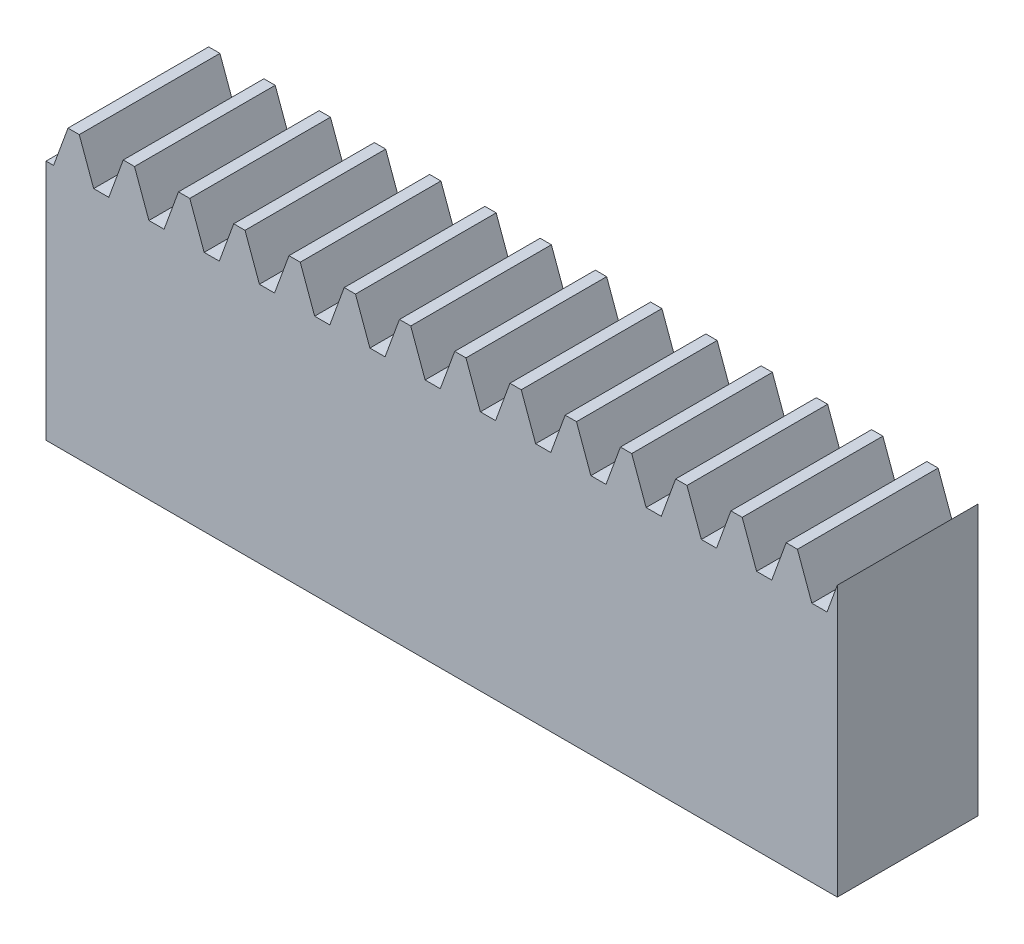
ISO-10303-21;
HEADER;
FILE_DESCRIPTION(('STEP AP214'),'2;1');
FILE_NAME('part.step','',(''),(''),'','','');
FILE_SCHEMA(('AUTOMOTIVE_DESIGN { 1 0 10303 214 1 1 1 1 }'));
ENDSEC;
DATA;
#1=APPLICATION_CONTEXT('core data for automotive mechanical design processes');
#2=APPLICATION_PROTOCOL_DEFINITION('international standard','automotive_design',2000,#1);
#3=PRODUCT_CONTEXT('',#1,'mechanical');
#4=PRODUCT('Part','Part','',(#3));
#5=PRODUCT_RELATED_PRODUCT_CATEGORY('part','',(#4));
#6=PRODUCT_DEFINITION_FORMATION('','',#4);
#7=PRODUCT_DEFINITION_CONTEXT('part definition',#1,'design');
#8=PRODUCT_DEFINITION('design','',#6,#7);
#9=PRODUCT_DEFINITION_SHAPE('','',#8);
#10=(LENGTH_UNIT() NAMED_UNIT(*) SI_UNIT(.MILLI.,.METRE.));
#11=(NAMED_UNIT(*) PLANE_ANGLE_UNIT() SI_UNIT($,.RADIAN.));
#12=(NAMED_UNIT(*) SI_UNIT($,.STERADIAN.) SOLID_ANGLE_UNIT());
#13=UNCERTAINTY_MEASURE_WITH_UNIT(LENGTH_MEASURE(1.E-05),#10,'distance_accuracy_value','');
#14=(GEOMETRIC_REPRESENTATION_CONTEXT(3) GLOBAL_UNCERTAINTY_ASSIGNED_CONTEXT((#13)) GLOBAL_UNIT_ASSIGNED_CONTEXT((#10,
#11,#12)) REPRESENTATION_CONTEXT('',''));
#15=CARTESIAN_POINT('',(0.,0.,0.));
#16=DIRECTION('',(0.,0.,1.));
#17=DIRECTION('',(1.,0.,0.));
#18=AXIS2_PLACEMENT_3D('',#15,#16,#17);
#19=CARTESIAN_POINT('',(-59.0426261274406,20.2635637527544,-16.0453056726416));
#20=DIRECTION('',(0.,1.,0.));
#21=DIRECTION('',(0.,0.,1.));
#22=AXIS2_PLACEMENT_3D('',#19,#20,#21);
#23=PLANE('',#22);
#24=DIRECTION('',(0.,0.,1.));
#25=VECTOR('',#24,1.);
#26=CARTESIAN_POINT('',(20.139045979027,20.2635637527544,-16.0453056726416));
#27=LINE('',#26,#25);
#28=CARTESIAN_POINT('',(20.139045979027,20.2635637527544,-16.0453056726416));
#29=VERTEX_POINT('',#28);
#30=CARTESIAN_POINT('',(20.139045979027,20.2635637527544,-0.0453056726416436));
#31=VERTEX_POINT('',#30);
#32=EDGE_CURVE('E469',#29,#31,#27,.T.);
#33=ORIENTED_EDGE('',*,*,#32,.F.);
#34=DIRECTION('',(-1.,0.,0.));
#35=VECTOR('',#34,1.);
#36=CARTESIAN_POINT('',(-59.0426261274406,20.2635637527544,-16.0453056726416));
#37=LINE('',#36,#35);
#38=CARTESIAN_POINT('',(18.8553342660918,20.2635637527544,-16.0453056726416));
#39=VERTEX_POINT('',#38);
#40=EDGE_CURVE('E908',#29,#39,#37,.T.);
#41=ORIENTED_EDGE('',*,*,#40,.T.);
#42=DIRECTION('',(0.,0.,-1.));
#43=VECTOR('',#42,1.);
#44=CARTESIAN_POINT('',(18.8553342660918,20.2635637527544,-16.0453056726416));
#45=LINE('',#44,#43);
#46=CARTESIAN_POINT('',(18.8553342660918,20.2635637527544,-0.0453056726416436));
#47=VERTEX_POINT('',#46);
#48=EDGE_CURVE('E496',#47,#39,#45,.T.);
#49=ORIENTED_EDGE('',*,*,#48,.F.);
#50=DIRECTION('',(-1.,0.,0.));
#51=VECTOR('',#50,1.);
#52=CARTESIAN_POINT('',(-59.0426261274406,20.2635637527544,-0.0453056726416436));
#53=LINE('',#52,#51);
#54=EDGE_CURVE('E922',#31,#47,#53,.T.);
#55=ORIENTED_EDGE('',*,*,#54,.F.);
#56=EDGE_LOOP('',(#33,#41,#49,#55));
#57=FACE_BOUND('',#56,.T.);
#58=ADVANCED_FACE('F16',(#57),#23,.T.);
#59=DIRECTION('',(0.,0.,1.));
#60=VECTOR('',#59,1.);
#61=CARTESIAN_POINT('',(13.855860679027,20.2635637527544,-16.0453056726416));
#62=LINE('',#61,#60);
#63=CARTESIAN_POINT('',(13.855860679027,20.2635637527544,-16.0453056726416));
#64=VERTEX_POINT('',#63);
#65=CARTESIAN_POINT('',(13.855860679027,20.2635637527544,-0.0453056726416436));
#66=VERTEX_POINT('',#65);
#67=EDGE_CURVE('E502',#64,#66,#62,.T.);
#68=ORIENTED_EDGE('',*,*,#67,.F.);
#69=CARTESIAN_POINT('',(12.5721489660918,20.2635637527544,-16.0453056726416));
#70=VERTEX_POINT('',#69);
#71=EDGE_CURVE('E1132',#64,#70,#37,.T.);
#72=ORIENTED_EDGE('',*,*,#71,.T.);
#73=DIRECTION('',(0.,0.,-1.));
#74=VECTOR('',#73,1.);
#75=CARTESIAN_POINT('',(12.5721489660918,20.2635637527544,-16.0453056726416));
#76=LINE('',#75,#74);
#77=CARTESIAN_POINT('',(12.5721489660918,20.2635637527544,-0.0453056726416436));
#78=VERTEX_POINT('',#77);
#79=EDGE_CURVE('E529',#78,#70,#76,.T.);
#80=ORIENTED_EDGE('',*,*,#79,.F.);
#81=EDGE_CURVE('E995',#66,#78,#53,.T.);
#82=ORIENTED_EDGE('',*,*,#81,.F.);
#83=EDGE_LOOP('',(#68,#72,#80,#82));
#84=FACE_BOUND('',#83,.T.);
#85=ADVANCED_FACE('F1155',(#84),#23,.T.);
#86=DIRECTION('',(0.,0.,1.));
#87=VECTOR('',#86,1.);
#88=CARTESIAN_POINT('',(7.57267537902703,20.2635637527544,-16.0453056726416));
#89=LINE('',#88,#87);
#90=CARTESIAN_POINT('',(7.57267537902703,20.2635637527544,-16.0453056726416));
#91=VERTEX_POINT('',#90);
#92=CARTESIAN_POINT('',(7.57267537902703,20.2635637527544,-0.0453056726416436));
#93=VERTEX_POINT('',#92);
#94=EDGE_CURVE('E535',#91,#93,#89,.T.);
#95=ORIENTED_EDGE('',*,*,#94,.F.);
#96=CARTESIAN_POINT('',(6.28896366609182,20.2635637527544,-16.0453056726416));
#97=VERTEX_POINT('',#96);
#98=EDGE_CURVE('E1125',#91,#97,#37,.T.);
#99=ORIENTED_EDGE('',*,*,#98,.T.);
#100=DIRECTION('',(0.,0.,-1.));
#101=VECTOR('',#100,1.);
#102=CARTESIAN_POINT('',(6.28896366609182,20.2635637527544,-16.0453056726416));
#103=LINE('',#102,#101);
#104=CARTESIAN_POINT('',(6.28896366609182,20.2635637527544,-0.0453056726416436));
#105=VERTEX_POINT('',#104);
#106=EDGE_CURVE('E562',#105,#97,#103,.T.);
#107=ORIENTED_EDGE('',*,*,#106,.F.);
#108=EDGE_CURVE('E998',#93,#105,#53,.T.);
#109=ORIENTED_EDGE('',*,*,#108,.F.);
#110=EDGE_LOOP('',(#95,#99,#107,#109));
#111=FACE_BOUND('',#110,.T.);
#112=ADVANCED_FACE('F1165',(#111),#23,.T.);
#113=DIRECTION('',(0.,0.,1.));
#114=VECTOR('',#113,1.);
#115=CARTESIAN_POINT('',(1.28949007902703,20.2635637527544,-16.0453056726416));
#116=LINE('',#115,#114);
#117=CARTESIAN_POINT('',(1.28949007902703,20.2635637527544,-16.0453056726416));
#118=VERTEX_POINT('',#117);
#119=CARTESIAN_POINT('',(1.28949007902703,20.2635637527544,-0.0453056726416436));
#120=VERTEX_POINT('',#119);
#121=EDGE_CURVE('E568',#118,#120,#116,.T.);
#122=ORIENTED_EDGE('',*,*,#121,.F.);
#123=CARTESIAN_POINT('',(0.0057783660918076,20.2635637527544,-16.0453056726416));
#124=VERTEX_POINT('',#123);
#125=EDGE_CURVE('E1118',#118,#124,#37,.T.);
#126=ORIENTED_EDGE('',*,*,#125,.T.);
#127=DIRECTION('',(0.,0.,-1.));
#128=VECTOR('',#127,1.);
#129=CARTESIAN_POINT('',(0.00577836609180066,20.2635637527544,-16.0453056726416));
#130=LINE('',#129,#128);
#131=CARTESIAN_POINT('',(0.0057783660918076,20.2635637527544,-0.0453056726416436));
#132=VERTEX_POINT('',#131);
#133=EDGE_CURVE('E595',#132,#124,#130,.T.);
#134=ORIENTED_EDGE('',*,*,#133,.F.);
#135=EDGE_CURVE('E1003',#120,#132,#53,.T.);
#136=ORIENTED_EDGE('',*,*,#135,.F.);
#137=EDGE_LOOP('',(#122,#126,#134,#136));
#138=FACE_BOUND('',#137,.T.);
#139=ADVANCED_FACE('F1175',(#138),#23,.T.);
#140=DIRECTION('',(0.,0.,1.));
#141=VECTOR('',#140,1.);
#142=CARTESIAN_POINT('',(-4.99369522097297,20.2635637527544,-16.0453056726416));
#143=LINE('',#142,#141);
#144=CARTESIAN_POINT('',(-4.99369522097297,20.2635637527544,-16.0453056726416));
#145=VERTEX_POINT('',#144);
#146=CARTESIAN_POINT('',(-4.99369522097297,20.2635637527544,-0.0453056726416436));
#147=VERTEX_POINT('',#146);
#148=EDGE_CURVE('E601',#145,#147,#143,.T.);
#149=ORIENTED_EDGE('',*,*,#148,.F.);
#150=CARTESIAN_POINT('',(-6.27740693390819,20.2635637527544,-16.0453056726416));
#151=VERTEX_POINT('',#150);
#152=EDGE_CURVE('E1111',#145,#151,#37,.T.);
#153=ORIENTED_EDGE('',*,*,#152,.T.);
#154=DIRECTION('',(0.,0.,-1.));
#155=VECTOR('',#154,1.);
#156=CARTESIAN_POINT('',(-6.27740693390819,20.2635637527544,-16.0453056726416));
#157=LINE('',#156,#155);
#158=CARTESIAN_POINT('',(-6.27740693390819,20.2635637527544,-0.0453056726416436));
#159=VERTEX_POINT('',#158);
#160=EDGE_CURVE('E628',#159,#151,#157,.T.);
#161=ORIENTED_EDGE('',*,*,#160,.F.);
#162=EDGE_CURVE('E1008',#147,#159,#53,.T.);
#163=ORIENTED_EDGE('',*,*,#162,.F.);
#164=EDGE_LOOP('',(#149,#153,#161,#163));
#165=FACE_BOUND('',#164,.T.);
#166=ADVANCED_FACE('F1185',(#165),#23,.T.);
#167=DIRECTION('',(0.,0.,1.));
#168=VECTOR('',#167,1.);
#169=CARTESIAN_POINT('',(-11.276880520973,20.2635637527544,-16.0453056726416));
#170=LINE('',#169,#168);
#171=CARTESIAN_POINT('',(-11.276880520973,20.2635637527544,-16.0453056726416));
#172=VERTEX_POINT('',#171);
#173=CARTESIAN_POINT('',(-11.276880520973,20.2635637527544,-0.0453056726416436));
#174=VERTEX_POINT('',#173);
#175=EDGE_CURVE('E634',#172,#174,#170,.T.);
#176=ORIENTED_EDGE('',*,*,#175,.F.);
#177=CARTESIAN_POINT('',(-12.5605922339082,20.2635637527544,-16.0453056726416));
#178=VERTEX_POINT('',#177);
#179=EDGE_CURVE('E1104',#172,#178,#37,.T.);
#180=ORIENTED_EDGE('',*,*,#179,.T.);
#181=DIRECTION('',(0.,0.,-1.));
#182=VECTOR('',#181,1.);
#183=CARTESIAN_POINT('',(-12.5605922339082,20.2635637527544,-16.0453056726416));
#184=LINE('',#183,#182);
#185=CARTESIAN_POINT('',(-12.5605922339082,20.2635637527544,-0.0453056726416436));
#186=VERTEX_POINT('',#185);
#187=EDGE_CURVE('E661',#186,#178,#184,.T.);
#188=ORIENTED_EDGE('',*,*,#187,.F.);
#189=EDGE_CURVE('E1013',#174,#186,#53,.T.);
#190=ORIENTED_EDGE('',*,*,#189,.F.);
#191=EDGE_LOOP('',(#176,#180,#188,#190));
#192=FACE_BOUND('',#191,.T.);
#193=ADVANCED_FACE('F1195',(#192),#23,.T.);
#194=DIRECTION('',(0.,0.,1.));
#195=VECTOR('',#194,1.);
#196=CARTESIAN_POINT('',(-17.560065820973,20.2635637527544,-16.0453056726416));
#197=LINE('',#196,#195);
#198=CARTESIAN_POINT('',(-17.560065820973,20.2635637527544,-16.0453056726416));
#199=VERTEX_POINT('',#198);
#200=CARTESIAN_POINT('',(-17.560065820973,20.2635637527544,-0.0453056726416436));
#201=VERTEX_POINT('',#200);
#202=EDGE_CURVE('E667',#199,#201,#197,.T.);
#203=ORIENTED_EDGE('',*,*,#202,.F.);
#204=CARTESIAN_POINT('',(-18.8437775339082,20.2635637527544,-16.0453056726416));
#205=VERTEX_POINT('',#204);
#206=EDGE_CURVE('E1097',#199,#205,#37,.T.);
#207=ORIENTED_EDGE('',*,*,#206,.T.);
#208=DIRECTION('',(0.,0.,-1.));
#209=VECTOR('',#208,1.);
#210=CARTESIAN_POINT('',(-18.8437775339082,20.2635637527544,-16.0453056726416));
#211=LINE('',#210,#209);
#212=CARTESIAN_POINT('',(-18.8437775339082,20.2635637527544,-0.0453056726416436));
#213=VERTEX_POINT('',#212);
#214=EDGE_CURVE('E694',#213,#205,#211,.T.);
#215=ORIENTED_EDGE('',*,*,#214,.F.);
#216=EDGE_CURVE('E1018',#201,#213,#53,.T.);
#217=ORIENTED_EDGE('',*,*,#216,.F.);
#218=EDGE_LOOP('',(#203,#207,#215,#217));
#219=FACE_BOUND('',#218,.T.);
#220=ADVANCED_FACE('F1205',(#219),#23,.T.);
#221=DIRECTION('',(0.,0.,1.));
#222=VECTOR('',#221,1.);
#223=CARTESIAN_POINT('',(-23.843251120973,20.2635637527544,-16.0453056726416));
#224=LINE('',#223,#222);
#225=CARTESIAN_POINT('',(-23.843251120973,20.2635637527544,-16.0453056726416));
#226=VERTEX_POINT('',#225);
#227=CARTESIAN_POINT('',(-23.843251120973,20.2635637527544,-0.0453056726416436));
#228=VERTEX_POINT('',#227);
#229=EDGE_CURVE('E700',#226,#228,#224,.T.);
#230=ORIENTED_EDGE('',*,*,#229,.F.);
#231=CARTESIAN_POINT('',(-25.1269628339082,20.2635637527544,-16.0453056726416));
#232=VERTEX_POINT('',#231);
#233=EDGE_CURVE('E1090',#226,#232,#37,.T.);
#234=ORIENTED_EDGE('',*,*,#233,.T.);
#235=DIRECTION('',(0.,0.,-1.));
#236=VECTOR('',#235,1.);
#237=CARTESIAN_POINT('',(-25.1269628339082,20.2635637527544,-16.0453056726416));
#238=LINE('',#237,#236);
#239=CARTESIAN_POINT('',(-25.1269628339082,20.2635637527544,-0.0453056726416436));
#240=VERTEX_POINT('',#239);
#241=EDGE_CURVE('E727',#240,#232,#238,.T.);
#242=ORIENTED_EDGE('',*,*,#241,.F.);
#243=EDGE_CURVE('E1023',#228,#240,#53,.T.);
#244=ORIENTED_EDGE('',*,*,#243,.F.);
#245=EDGE_LOOP('',(#230,#234,#242,#244));
#246=FACE_BOUND('',#245,.T.);
#247=ADVANCED_FACE('F1215',(#246),#23,.T.);
#248=DIRECTION('',(0.,0.,1.));
#249=VECTOR('',#248,1.);
#250=CARTESIAN_POINT('',(-30.126436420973,20.2635637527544,-16.0453056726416));
#251=LINE('',#250,#249);
#252=CARTESIAN_POINT('',(-30.126436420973,20.2635637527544,-16.0453056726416));
#253=VERTEX_POINT('',#252);
#254=CARTESIAN_POINT('',(-30.126436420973,20.2635637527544,-0.0453056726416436));
#255=VERTEX_POINT('',#254);
#256=EDGE_CURVE('E733',#253,#255,#251,.T.);
#257=ORIENTED_EDGE('',*,*,#256,.F.);
#258=CARTESIAN_POINT('',(-31.4101481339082,20.2635637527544,-16.0453056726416));
#259=VERTEX_POINT('',#258);
#260=EDGE_CURVE('E1083',#253,#259,#37,.T.);
#261=ORIENTED_EDGE('',*,*,#260,.T.);
#262=DIRECTION('',(0.,0.,-1.));
#263=VECTOR('',#262,1.);
#264=CARTESIAN_POINT('',(-31.4101481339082,20.2635637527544,-16.0453056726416));
#265=LINE('',#264,#263);
#266=CARTESIAN_POINT('',(-31.4101481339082,20.2635637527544,-0.0453056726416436));
#267=VERTEX_POINT('',#266);
#268=EDGE_CURVE('E760',#267,#259,#265,.T.);
#269=ORIENTED_EDGE('',*,*,#268,.F.);
#270=EDGE_CURVE('E1028',#255,#267,#53,.T.);
#271=ORIENTED_EDGE('',*,*,#270,.F.);
#272=EDGE_LOOP('',(#257,#261,#269,#271));
#273=FACE_BOUND('',#272,.T.);
#274=ADVANCED_FACE('F1225',(#273),#23,.T.);
#275=DIRECTION('',(0.,0.,1.));
#276=VECTOR('',#275,1.);
#277=CARTESIAN_POINT('',(-36.409621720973,20.2635637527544,-16.0453056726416));
#278=LINE('',#277,#276);
#279=CARTESIAN_POINT('',(-36.409621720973,20.2635637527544,-16.0453056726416));
#280=VERTEX_POINT('',#279);
#281=CARTESIAN_POINT('',(-36.409621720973,20.2635637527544,-0.0453056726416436));
#282=VERTEX_POINT('',#281);
#283=EDGE_CURVE('E766',#280,#282,#278,.T.);
#284=ORIENTED_EDGE('',*,*,#283,.F.);
#285=CARTESIAN_POINT('',(-37.6933334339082,20.2635637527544,-16.0453056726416));
#286=VERTEX_POINT('',#285);
#287=EDGE_CURVE('E1076',#280,#286,#37,.T.);
#288=ORIENTED_EDGE('',*,*,#287,.T.);
#289=DIRECTION('',(0.,0.,-1.));
#290=VECTOR('',#289,1.);
#291=CARTESIAN_POINT('',(-37.6933334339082,20.2635637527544,-16.0453056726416));
#292=LINE('',#291,#290);
#293=CARTESIAN_POINT('',(-37.6933334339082,20.2635637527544,-0.0453056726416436));
#294=VERTEX_POINT('',#293);
#295=EDGE_CURVE('E793',#294,#286,#292,.T.);
#296=ORIENTED_EDGE('',*,*,#295,.F.);
#297=EDGE_CURVE('E1033',#282,#294,#53,.T.);
#298=ORIENTED_EDGE('',*,*,#297,.F.);
#299=EDGE_LOOP('',(#284,#288,#296,#298));
#300=FACE_BOUND('',#299,.T.);
#301=ADVANCED_FACE('F1235',(#300),#23,.T.);
#302=DIRECTION('',(0.,0.,1.));
#303=VECTOR('',#302,1.);
#304=CARTESIAN_POINT('',(-42.692807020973,20.2635637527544,-16.0453056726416));
#305=LINE('',#304,#303);
#306=CARTESIAN_POINT('',(-42.692807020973,20.2635637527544,-16.0453056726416));
#307=VERTEX_POINT('',#306);
#308=CARTESIAN_POINT('',(-42.692807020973,20.2635637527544,-0.0453056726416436));
#309=VERTEX_POINT('',#308);
#310=EDGE_CURVE('E799',#307,#309,#305,.T.);
#311=ORIENTED_EDGE('',*,*,#310,.F.);
#312=CARTESIAN_POINT('',(-43.9765187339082,20.2635637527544,-16.0453056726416));
#313=VERTEX_POINT('',#312);
#314=EDGE_CURVE('E1069',#307,#313,#37,.T.);
#315=ORIENTED_EDGE('',*,*,#314,.T.);
#316=DIRECTION('',(0.,0.,-1.));
#317=VECTOR('',#316,1.);
#318=CARTESIAN_POINT('',(-43.9765187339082,20.2635637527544,-16.0453056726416));
#319=LINE('',#318,#317);
#320=CARTESIAN_POINT('',(-43.9765187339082,20.2635637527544,-0.0453056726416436));
#321=VERTEX_POINT('',#320);
#322=EDGE_CURVE('E826',#321,#313,#319,.T.);
#323=ORIENTED_EDGE('',*,*,#322,.F.);
#324=EDGE_CURVE('E1038',#309,#321,#53,.T.);
#325=ORIENTED_EDGE('',*,*,#324,.F.);
#326=EDGE_LOOP('',(#311,#315,#323,#325));
#327=FACE_BOUND('',#326,.T.);
#328=ADVANCED_FACE('F1245',(#327),#23,.T.);
#329=DIRECTION('',(0.,0.,1.));
#330=VECTOR('',#329,1.);
#331=CARTESIAN_POINT('',(-48.975992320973,20.2635637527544,-16.0453056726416));
#332=LINE('',#331,#330);
#333=CARTESIAN_POINT('',(-48.975992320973,20.2635637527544,-16.0453056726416));
#334=VERTEX_POINT('',#333);
#335=CARTESIAN_POINT('',(-48.975992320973,20.2635637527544,-0.0453056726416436));
#336=VERTEX_POINT('',#335);
#337=EDGE_CURVE('E832',#334,#336,#332,.T.);
#338=ORIENTED_EDGE('',*,*,#337,.F.);
#339=CARTESIAN_POINT('',(-50.2597040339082,20.2635637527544,-16.0453056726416));
#340=VERTEX_POINT('',#339);
#341=EDGE_CURVE('E1066',#334,#340,#37,.T.);
#342=ORIENTED_EDGE('',*,*,#341,.T.);
#343=DIRECTION('',(0.,0.,-1.));
#344=VECTOR('',#343,1.);
#345=CARTESIAN_POINT('',(-50.2597040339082,20.2635637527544,-16.0453056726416));
#346=LINE('',#345,#344);
#347=CARTESIAN_POINT('',(-50.2597040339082,20.2635637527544,-0.0453056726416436));
#348=VERTEX_POINT('',#347);
#349=EDGE_CURVE('E859',#348,#340,#346,.T.);
#350=ORIENTED_EDGE('',*,*,#349,.F.);
#351=EDGE_CURVE('E1043',#336,#348,#53,.T.);
#352=ORIENTED_EDGE('',*,*,#351,.F.);
#353=EDGE_LOOP('',(#338,#342,#350,#352));
#354=FACE_BOUND('',#353,.T.);
#355=ADVANCED_FACE('F1255',(#354),#23,.T.);
#356=DIRECTION('',(0.,0.,1.));
#357=VECTOR('',#356,1.);
#358=CARTESIAN_POINT('',(-55.259177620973,20.2635637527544,-16.0453056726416));
#359=LINE('',#358,#357);
#360=CARTESIAN_POINT('',(-55.259177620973,20.2635637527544,-16.0453056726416));
#361=VERTEX_POINT('',#360);
#362=CARTESIAN_POINT('',(-55.259177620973,20.2635637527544,-0.0453056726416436));
#363=VERTEX_POINT('',#362);
#364=EDGE_CURVE('E865',#361,#363,#359,.T.);
#365=ORIENTED_EDGE('',*,*,#364,.F.);
#366=CARTESIAN_POINT('',(-56.5428893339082,20.2635637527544,-16.0453056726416));
#367=VERTEX_POINT('',#366);
#368=EDGE_CURVE('E904',#361,#367,#37,.T.);
#369=ORIENTED_EDGE('',*,*,#368,.T.);
#370=DIRECTION('',(0.,0.,-1.));
#371=VECTOR('',#370,1.);
#372=CARTESIAN_POINT('',(-56.5428893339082,20.2635637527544,-16.0453056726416));
#373=LINE('',#372,#371);
#374=CARTESIAN_POINT('',(-56.5428893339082,20.2635637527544,-0.0453056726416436));
#375=VERTEX_POINT('',#374);
#376=EDGE_CURVE('E887',#375,#367,#373,.T.);
#377=ORIENTED_EDGE('',*,*,#376,.F.);
#378=EDGE_CURVE('E919',#363,#375,#53,.T.);
#379=ORIENTED_EDGE('',*,*,#378,.F.);
#380=EDGE_LOOP('',(#365,#369,#377,#379));
#381=FACE_BOUND('',#380,.T.);
#382=ADVANCED_FACE('F1063',(#381),#23,.T.);
#383=CARTESIAN_POINT('',(-59.0426261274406,-11.7364362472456,-16.0453056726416));
#384=DIRECTION('',(-1.,0.,0.));
#385=DIRECTION('',(0.,0.,1.));
#386=AXIS2_PLACEMENT_3D('',#383,#384,#385);
#387=PLANE('',#386);
#388=DIRECTION('',(0.,0.,1.));
#389=VECTOR('',#388,1.);
#390=CARTESIAN_POINT('',(-59.0426261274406,15.7635637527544,-16.0453056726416));
#391=LINE('',#390,#389);
#392=CARTESIAN_POINT('',(-59.0426261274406,15.7635637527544,-16.0453056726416));
#393=VERTEX_POINT('',#392);
#394=CARTESIAN_POINT('',(-59.0426261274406,15.7635637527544,-0.0453056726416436));
#395=VERTEX_POINT('',#394);
#396=EDGE_CURVE('E884',#393,#395,#391,.T.);
#397=ORIENTED_EDGE('',*,*,#396,.F.);
#398=DIRECTION('',(0.,-1.,0.));
#399=VECTOR('',#398,1.);
#400=CARTESIAN_POINT('',(-59.0426261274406,-11.7364362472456,-16.0453056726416));
#401=LINE('',#400,#399);
#402=CARTESIAN_POINT('',(-59.0426261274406,-11.7364362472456,-16.0453056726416));
#403=VERTEX_POINT('',#402);
#404=EDGE_CURVE('E892',#393,#403,#401,.T.);
#405=ORIENTED_EDGE('',*,*,#404,.T.);
#406=DIRECTION('',(0.,0.,1.));
#407=VECTOR('',#406,1.);
#408=CARTESIAN_POINT('',(-59.0426261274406,-11.7364362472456,-16.0453056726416));
#409=LINE('',#408,#407);
#410=CARTESIAN_POINT('',(-59.0426261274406,-11.7364362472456,-0.0453056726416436));
#411=VERTEX_POINT('',#410);
#412=EDGE_CURVE('E907',#403,#411,#409,.T.);
#413=ORIENTED_EDGE('',*,*,#412,.T.);
#414=DIRECTION('',(0.,-1.,0.));
#415=VECTOR('',#414,1.);
#416=CARTESIAN_POINT('',(-59.0426261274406,-11.7364362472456,-0.0453056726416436));
#417=LINE('',#416,#415);
#418=EDGE_CURVE('E891',#395,#411,#417,.T.);
#419=ORIENTED_EDGE('',*,*,#418,.F.);
#420=EDGE_LOOP('',(#397,#405,#413,#419));
#421=FACE_BOUND('',#420,.T.);
#422=ADVANCED_FACE('F18',(#421),#387,.T.);
#423=DIRECTION('',(0.,0.,1.));
#424=VECTOR('',#423,1.);
#425=CARTESIAN_POINT('',(26.422231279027,20.2635637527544,-16.0453056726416));
#426=LINE('',#425,#424);
#427=CARTESIAN_POINT('',(26.422231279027,20.2635637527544,-16.0453056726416));
#428=VERTEX_POINT('',#427);
#429=CARTESIAN_POINT('',(26.422231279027,20.2635637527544,-0.0453056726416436));
#430=VERTEX_POINT('',#429);
#431=EDGE_CURVE('E439',#428,#430,#426,.T.);
#432=ORIENTED_EDGE('',*,*,#431,.F.);
#433=CARTESIAN_POINT('',(25.1385195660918,20.2635637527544,-16.0453056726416));
#434=VERTEX_POINT('',#433);
#435=EDGE_CURVE('E420',#428,#434,#37,.T.);
#436=ORIENTED_EDGE('',*,*,#435,.T.);
#437=DIRECTION('',(0.,0.,-1.));
#438=VECTOR('',#437,1.);
#439=CARTESIAN_POINT('',(25.1385195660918,20.2635637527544,-16.0453056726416));
#440=LINE('',#439,#438);
#441=CARTESIAN_POINT('',(25.1385195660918,20.2635637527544,-0.0453056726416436));
#442=VERTEX_POINT('',#441);
#443=EDGE_CURVE('E463',#442,#434,#440,.T.);
#444=ORIENTED_EDGE('',*,*,#443,.F.);
#445=EDGE_CURVE('E896',#430,#442,#53,.T.);
#446=ORIENTED_EDGE('',*,*,#445,.F.);
#447=EDGE_LOOP('',(#432,#436,#444,#446));
#448=FACE_BOUND('',#447,.T.);
#449=ADVANCED_FACE('F1279',(#448),#23,.T.);
#450=CARTESIAN_POINT('',(30.9573738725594,-11.7364362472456,-16.0453056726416));
#451=DIRECTION('',(1.,0.,0.));
#452=DIRECTION('',(0.,0.,-1.));
#453=AXIS2_PLACEMENT_3D('',#450,#451,#452);
#454=PLANE('',#453);
#455=DIRECTION('',(0.,0.,-1.));
#456=VECTOR('',#455,1.);
#457=CARTESIAN_POINT('',(30.9573738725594,18.9878248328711,-16.0453056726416));
#458=LINE('',#457,#456);
#459=CARTESIAN_POINT('',(30.9573738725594,18.9878248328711,-0.0453056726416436));
#460=VERTEX_POINT('',#459);
#461=CARTESIAN_POINT('',(30.9573738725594,18.9878248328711,-16.0453056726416));
#462=VERTEX_POINT('',#461);
#463=EDGE_CURVE('E435',#460,#462,#458,.T.);
#464=ORIENTED_EDGE('',*,*,#463,.F.);
#465=DIRECTION('',(0.,1.,0.));
#466=VECTOR('',#465,1.);
#467=CARTESIAN_POINT('',(30.9573738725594,-11.7364362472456,-0.0453056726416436));
#468=LINE('',#467,#466);
#469=CARTESIAN_POINT('',(30.9573738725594,-11.7364362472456,-0.0453056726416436));
#470=VERTEX_POINT('',#469);
#471=EDGE_CURVE('E915',#470,#460,#468,.T.);
#472=ORIENTED_EDGE('',*,*,#471,.F.);
#473=DIRECTION('',(0.,0.,1.));
#474=VECTOR('',#473,1.);
#475=CARTESIAN_POINT('',(30.9573738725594,-11.7364362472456,-16.0453056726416));
#476=LINE('',#475,#474);
#477=CARTESIAN_POINT('',(30.9573738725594,-11.7364362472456,-16.0453056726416));
#478=VERTEX_POINT('',#477);
#479=EDGE_CURVE('E923',#478,#470,#476,.T.);
#480=ORIENTED_EDGE('',*,*,#479,.F.);
#481=DIRECTION('',(0.,1.,0.));
#482=VECTOR('',#481,1.);
#483=CARTESIAN_POINT('',(30.9573738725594,-11.7364362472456,-16.0453056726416));
#484=LINE('',#483,#482);
#485=EDGE_CURVE('E900',#478,#462,#484,.T.);
#486=ORIENTED_EDGE('',*,*,#485,.T.);
#487=EDGE_LOOP('',(#464,#472,#480,#486));
#488=FACE_BOUND('',#487,.T.);
#489=ADVANCED_FACE('F1286',(#488),#454,.T.);
#490=CARTESIAN_POINT('',(-59.0426261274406,-11.7364362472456,-16.0453056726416));
#491=DIRECTION('',(0.,-1.,0.));
#492=DIRECTION('',(0.,0.,-1.));
#493=AXIS2_PLACEMENT_3D('',#490,#491,#492);
#494=PLANE('',#493);
#495=DIRECTION('',(1.,0.,0.));
#496=VECTOR('',#495,1.);
#497=CARTESIAN_POINT('',(-59.0426261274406,-11.7364362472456,-0.0453056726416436));
#498=LINE('',#497,#496);
#499=EDGE_CURVE('E911',#411,#470,#498,.T.);
#500=ORIENTED_EDGE('',*,*,#499,.F.);
#501=ORIENTED_EDGE('',*,*,#412,.F.);
#502=DIRECTION('',(1.,0.,0.));
#503=VECTOR('',#502,1.);
#504=CARTESIAN_POINT('',(-59.0426261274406,-11.7364362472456,-16.0453056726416));
#505=LINE('',#504,#503);
#506=EDGE_CURVE('E895',#403,#478,#505,.T.);
#507=ORIENTED_EDGE('',*,*,#506,.T.);
#508=ORIENTED_EDGE('',*,*,#479,.T.);
#509=EDGE_LOOP('',(#500,#501,#507,#508));
#510=FACE_BOUND('',#509,.T.);
#511=ADVANCED_FACE('F1292',(#510),#494,.T.);
#512=CARTESIAN_POINT('',(-59.0426261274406,20.2635637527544,-16.0453056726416));
#513=DIRECTION('',(0.,0.,-1.));
#514=DIRECTION('',(-1.,0.,0.));
#515=AXIS2_PLACEMENT_3D('',#512,#513,#514);
#516=PLANE('',#515);
#517=DIRECTION('',(0.342020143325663,-0.93969262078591,0.));
#518=VECTOR('',#517,1.);
#519=CARTESIAN_POINT('',(26.4129864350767,20.2889637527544,-16.0453056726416));
#520=LINE('',#519,#518);
#521=CARTESIAN_POINT('',(28.0600973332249,15.7635637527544,-16.0453056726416));
#522=VERTEX_POINT('',#521);
#523=EDGE_CURVE('E402',#428,#522,#520,.T.);
#524=ORIENTED_EDGE('',*,*,#523,.T.);
#525=DIRECTION('',(1.,0.,0.));
#526=VECTOR('',#525,1.);
#527=CARTESIAN_POINT('',(29.7838388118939,15.7635637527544,-16.0453056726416));
#528=LINE('',#527,#526);
#529=CARTESIAN_POINT('',(29.7838388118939,15.7635637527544,-16.0453056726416));
#530=VERTEX_POINT('',#529);
#531=EDGE_CURVE('E410',#522,#530,#528,.T.);
#532=ORIENTED_EDGE('',*,*,#531,.T.);
#533=DIRECTION('',(0.342020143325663,0.93969262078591,0.));
#534=VECTOR('',#533,1.);
#535=CARTESIAN_POINT('',(31.4309497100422,20.2889637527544,-16.0453056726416));
#536=LINE('',#535,#534);
#537=EDGE_CURVE('E407',#530,#462,#536,.T.);
#538=ORIENTED_EDGE('',*,*,#537,.T.);
#539=ORIENTED_EDGE('',*,*,#485,.F.);
#540=ORIENTED_EDGE('',*,*,#506,.F.);
#541=ORIENTED_EDGE('',*,*,#404,.F.);
#542=DIRECTION('',(1.,0.,0.));
#543=VECTOR('',#542,1.);
#544=CARTESIAN_POINT('',(-58.1807553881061,15.7635637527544,-16.0453056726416));
#545=LINE('',#544,#543);
#546=CARTESIAN_POINT('',(-58.1807553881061,15.7635637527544,-16.0453056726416));
#547=VERTEX_POINT('',#546);
#548=EDGE_CURVE('E869',#393,#547,#545,.T.);
#549=ORIENTED_EDGE('',*,*,#548,.T.);
#550=DIRECTION('',(0.342020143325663,0.93969262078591,0.));
#551=VECTOR('',#550,1.);
#552=CARTESIAN_POINT('',(-56.5336444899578,20.2889637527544,-16.0453056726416));
#553=LINE('',#552,#551);
#554=EDGE_CURVE('E873',#547,#367,#553,.T.);
#555=ORIENTED_EDGE('',*,*,#554,.T.);
#556=ORIENTED_EDGE('',*,*,#368,.F.);
#557=DIRECTION('',(0.342020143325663,-0.93969262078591,0.));
#558=VECTOR('',#557,1.);
#559=CARTESIAN_POINT('',(-55.2684224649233,20.2889637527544,-16.0453056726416));
#560=LINE('',#559,#558);
#561=CARTESIAN_POINT('',(-53.6213115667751,15.7635637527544,-16.0453056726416));
#562=VERTEX_POINT('',#561);
#563=EDGE_CURVE('E836',#361,#562,#560,.T.);
#564=ORIENTED_EDGE('',*,*,#563,.T.);
#565=DIRECTION('',(1.,0.,0.));
#566=VECTOR('',#565,1.);
#567=CARTESIAN_POINT('',(-51.8975700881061,15.7635637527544,-16.0453056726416));
#568=LINE('',#567,#566);
#569=CARTESIAN_POINT('',(-51.8975700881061,15.7635637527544,-16.0453056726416));
#570=VERTEX_POINT('',#569);
#571=EDGE_CURVE('E840',#562,#570,#568,.T.);
#572=ORIENTED_EDGE('',*,*,#571,.T.);
#573=DIRECTION('',(0.342020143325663,0.93969262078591,0.));
#574=VECTOR('',#573,1.);
#575=CARTESIAN_POINT('',(-50.2504591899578,20.2889637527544,-16.0453056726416));
#576=LINE('',#575,#574);
#577=EDGE_CURVE('E845',#570,#340,#576,.T.);
#578=ORIENTED_EDGE('',*,*,#577,.T.);
#579=ORIENTED_EDGE('',*,*,#341,.F.);
#580=DIRECTION('',(0.342020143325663,-0.93969262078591,0.));
#581=VECTOR('',#580,1.);
#582=CARTESIAN_POINT('',(-48.9852371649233,20.2889637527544,-16.0453056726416));
#583=LINE('',#582,#581);
#584=CARTESIAN_POINT('',(-47.3381262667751,15.7635637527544,-16.0453056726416));
#585=VERTEX_POINT('',#584);
#586=EDGE_CURVE('E803',#334,#585,#583,.T.);
#587=ORIENTED_EDGE('',*,*,#586,.T.);
#588=DIRECTION('',(1.,0.,0.));
#589=VECTOR('',#588,1.);
#590=CARTESIAN_POINT('',(-45.6143847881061,15.7635637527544,-16.0453056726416));
#591=LINE('',#590,#589);
#592=CARTESIAN_POINT('',(-45.6143847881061,15.7635637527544,-16.0453056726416));
#593=VERTEX_POINT('',#592);
#594=EDGE_CURVE('E807',#585,#593,#591,.T.);
#595=ORIENTED_EDGE('',*,*,#594,.T.);
#596=DIRECTION('',(0.342020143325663,0.93969262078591,0.));
#597=VECTOR('',#596,1.);
#598=CARTESIAN_POINT('',(-43.9672738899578,20.2889637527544,-16.0453056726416));
#599=LINE('',#598,#597);
#600=EDGE_CURVE('E812',#593,#313,#599,.T.);
#601=ORIENTED_EDGE('',*,*,#600,.T.);
#602=ORIENTED_EDGE('',*,*,#314,.F.);
#603=DIRECTION('',(0.342020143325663,-0.93969262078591,0.));
#604=VECTOR('',#603,1.);
#605=CARTESIAN_POINT('',(-42.7020518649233,20.2889637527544,-16.0453056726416));
#606=LINE('',#605,#604);
#607=CARTESIAN_POINT('',(-41.0549409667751,15.7635637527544,-16.0453056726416));
#608=VERTEX_POINT('',#607);
#609=EDGE_CURVE('E770',#307,#608,#606,.T.);
#610=ORIENTED_EDGE('',*,*,#609,.T.);
#611=DIRECTION('',(1.,0.,0.));
#612=VECTOR('',#611,1.);
#613=CARTESIAN_POINT('',(-39.3311994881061,15.7635637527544,-16.0453056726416));
#614=LINE('',#613,#612);
#615=CARTESIAN_POINT('',(-39.3311994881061,15.7635637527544,-16.0453056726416));
#616=VERTEX_POINT('',#615);
#617=EDGE_CURVE('E774',#608,#616,#614,.T.);
#618=ORIENTED_EDGE('',*,*,#617,.T.);
#619=DIRECTION('',(0.342020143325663,0.93969262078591,0.));
#620=VECTOR('',#619,1.);
#621=CARTESIAN_POINT('',(-37.6840885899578,20.2889637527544,-16.0453056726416));
#622=LINE('',#621,#620);
#623=EDGE_CURVE('E779',#616,#286,#622,.T.);
#624=ORIENTED_EDGE('',*,*,#623,.T.);
#625=ORIENTED_EDGE('',*,*,#287,.F.);
#626=DIRECTION('',(0.342020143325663,-0.93969262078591,0.));
#627=VECTOR('',#626,1.);
#628=CARTESIAN_POINT('',(-36.4188665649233,20.2889637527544,-16.0453056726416));
#629=LINE('',#628,#627);
#630=CARTESIAN_POINT('',(-34.7717556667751,15.7635637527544,-16.0453056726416));
#631=VERTEX_POINT('',#630);
#632=EDGE_CURVE('E737',#280,#631,#629,.T.);
#633=ORIENTED_EDGE('',*,*,#632,.T.);
#634=DIRECTION('',(1.,0.,0.));
#635=VECTOR('',#634,1.);
#636=CARTESIAN_POINT('',(-33.0480141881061,15.7635637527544,-16.0453056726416));
#637=LINE('',#636,#635);
#638=CARTESIAN_POINT('',(-33.0480141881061,15.7635637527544,-16.0453056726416));
#639=VERTEX_POINT('',#638);
#640=EDGE_CURVE('E741',#631,#639,#637,.T.);
#641=ORIENTED_EDGE('',*,*,#640,.T.);
#642=DIRECTION('',(0.342020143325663,0.93969262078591,0.));
#643=VECTOR('',#642,1.);
#644=CARTESIAN_POINT('',(-31.4009032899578,20.2889637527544,-16.0453056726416));
#645=LINE('',#644,#643);
#646=EDGE_CURVE('E746',#639,#259,#645,.T.);
#647=ORIENTED_EDGE('',*,*,#646,.T.);
#648=ORIENTED_EDGE('',*,*,#260,.F.);
#649=DIRECTION('',(0.342020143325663,-0.93969262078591,0.));
#650=VECTOR('',#649,1.);
#651=CARTESIAN_POINT('',(-30.1356812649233,20.2889637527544,-16.0453056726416));
#652=LINE('',#651,#650);
#653=CARTESIAN_POINT('',(-28.4885703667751,15.7635637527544,-16.0453056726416));
#654=VERTEX_POINT('',#653);
#655=EDGE_CURVE('E704',#253,#654,#652,.T.);
#656=ORIENTED_EDGE('',*,*,#655,.T.);
#657=DIRECTION('',(1.,0.,0.));
#658=VECTOR('',#657,1.);
#659=CARTESIAN_POINT('',(-26.7648288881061,15.7635637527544,-16.0453056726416));
#660=LINE('',#659,#658);
#661=CARTESIAN_POINT('',(-26.7648288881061,15.7635637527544,-16.0453056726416));
#662=VERTEX_POINT('',#661);
#663=EDGE_CURVE('E708',#654,#662,#660,.T.);
#664=ORIENTED_EDGE('',*,*,#663,.T.);
#665=DIRECTION('',(0.342020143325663,0.93969262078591,0.));
#666=VECTOR('',#665,1.);
#667=CARTESIAN_POINT('',(-25.1177179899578,20.2889637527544,-16.0453056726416));
#668=LINE('',#667,#666);
#669=EDGE_CURVE('E713',#662,#232,#668,.T.);
#670=ORIENTED_EDGE('',*,*,#669,.T.);
#671=ORIENTED_EDGE('',*,*,#233,.F.);
#672=DIRECTION('',(0.342020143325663,-0.93969262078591,0.));
#673=VECTOR('',#672,1.);
#674=CARTESIAN_POINT('',(-23.8524959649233,20.2889637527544,-16.0453056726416));
#675=LINE('',#674,#673);
#676=CARTESIAN_POINT('',(-22.2053850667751,15.7635637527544,-16.0453056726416));
#677=VERTEX_POINT('',#676);
#678=EDGE_CURVE('E671',#226,#677,#675,.T.);
#679=ORIENTED_EDGE('',*,*,#678,.T.);
#680=DIRECTION('',(1.,0.,0.));
#681=VECTOR('',#680,1.);
#682=CARTESIAN_POINT('',(-20.4816435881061,15.7635637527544,-16.0453056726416));
#683=LINE('',#682,#681);
#684=CARTESIAN_POINT('',(-20.4816435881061,15.7635637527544,-16.0453056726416));
#685=VERTEX_POINT('',#684);
#686=EDGE_CURVE('E675',#677,#685,#683,.T.);
#687=ORIENTED_EDGE('',*,*,#686,.T.);
#688=DIRECTION('',(0.342020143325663,0.93969262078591,0.));
#689=VECTOR('',#688,1.);
#690=CARTESIAN_POINT('',(-18.8345326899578,20.2889637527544,-16.0453056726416));
#691=LINE('',#690,#689);
#692=EDGE_CURVE('E680',#685,#205,#691,.T.);
#693=ORIENTED_EDGE('',*,*,#692,.T.);
#694=ORIENTED_EDGE('',*,*,#206,.F.);
#695=DIRECTION('',(0.342020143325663,-0.93969262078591,0.));
#696=VECTOR('',#695,1.);
#697=CARTESIAN_POINT('',(-17.5693106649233,20.2889637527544,-16.0453056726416));
#698=LINE('',#697,#696);
#699=CARTESIAN_POINT('',(-15.9221997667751,15.7635637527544,-16.0453056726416));
#700=VERTEX_POINT('',#699);
#701=EDGE_CURVE('E638',#199,#700,#698,.T.);
#702=ORIENTED_EDGE('',*,*,#701,.T.);
#703=DIRECTION('',(1.,0.,0.));
#704=VECTOR('',#703,1.);
#705=CARTESIAN_POINT('',(-14.1984582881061,15.7635637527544,-16.0453056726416));
#706=LINE('',#705,#704);
#707=CARTESIAN_POINT('',(-14.1984582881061,15.7635637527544,-16.0453056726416));
#708=VERTEX_POINT('',#707);
#709=EDGE_CURVE('E642',#700,#708,#706,.T.);
#710=ORIENTED_EDGE('',*,*,#709,.T.);
#711=DIRECTION('',(0.342020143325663,0.93969262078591,0.));
#712=VECTOR('',#711,1.);
#713=CARTESIAN_POINT('',(-12.5513473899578,20.2889637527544,-16.0453056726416));
#714=LINE('',#713,#712);
#715=EDGE_CURVE('E647',#708,#178,#714,.T.);
#716=ORIENTED_EDGE('',*,*,#715,.T.);
#717=ORIENTED_EDGE('',*,*,#179,.F.);
#718=DIRECTION('',(0.342020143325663,-0.93969262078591,0.));
#719=VECTOR('',#718,1.);
#720=CARTESIAN_POINT('',(-11.2861253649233,20.2889637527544,-16.0453056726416));
#721=LINE('',#720,#719);
#722=CARTESIAN_POINT('',(-9.63901446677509,15.7635637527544,-16.0453056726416));
#723=VERTEX_POINT('',#722);
#724=EDGE_CURVE('E605',#172,#723,#721,.T.);
#725=ORIENTED_EDGE('',*,*,#724,.T.);
#726=DIRECTION('',(1.,0.,0.));
#727=VECTOR('',#726,1.);
#728=CARTESIAN_POINT('',(-7.91527298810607,15.7635637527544,-16.0453056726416));
#729=LINE('',#728,#727);
#730=CARTESIAN_POINT('',(-7.91527298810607,15.7635637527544,-16.0453056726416));
#731=VERTEX_POINT('',#730);
#732=EDGE_CURVE('E609',#723,#731,#729,.T.);
#733=ORIENTED_EDGE('',*,*,#732,.T.);
#734=DIRECTION('',(0.342020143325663,0.93969262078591,0.));
#735=VECTOR('',#734,1.);
#736=CARTESIAN_POINT('',(-6.26816208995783,20.2889637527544,-16.0453056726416));
#737=LINE('',#736,#735);
#738=EDGE_CURVE('E614',#731,#151,#737,.T.);
#739=ORIENTED_EDGE('',*,*,#738,.T.);
#740=ORIENTED_EDGE('',*,*,#152,.F.);
#741=DIRECTION('',(0.342020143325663,-0.93969262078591,0.));
#742=VECTOR('',#741,1.);
#743=CARTESIAN_POINT('',(-5.00294006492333,20.2889637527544,-16.0453056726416));
#744=LINE('',#743,#742);
#745=CARTESIAN_POINT('',(-3.35582916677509,15.7635637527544,-16.0453056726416));
#746=VERTEX_POINT('',#745);
#747=EDGE_CURVE('E572',#145,#746,#744,.T.);
#748=ORIENTED_EDGE('',*,*,#747,.T.);
#749=DIRECTION('',(1.,0.,0.));
#750=VECTOR('',#749,1.);
#751=CARTESIAN_POINT('',(-1.63208768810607,15.7635637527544,-16.0453056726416));
#752=LINE('',#751,#750);
#753=CARTESIAN_POINT('',(-1.63208768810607,15.7635637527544,-16.0453056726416));
#754=VERTEX_POINT('',#753);
#755=EDGE_CURVE('E576',#746,#754,#752,.T.);
#756=ORIENTED_EDGE('',*,*,#755,.T.);
#757=DIRECTION('',(0.342020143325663,0.93969262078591,0.));
#758=VECTOR('',#757,1.);
#759=CARTESIAN_POINT('',(0.0150232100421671,20.2889637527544,-16.0453056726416));
#760=LINE('',#759,#758);
#761=EDGE_CURVE('E581',#754,#124,#760,.T.);
#762=ORIENTED_EDGE('',*,*,#761,.T.);
#763=ORIENTED_EDGE('',*,*,#125,.F.);
#764=DIRECTION('',(0.342020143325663,-0.93969262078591,0.));
#765=VECTOR('',#764,1.);
#766=CARTESIAN_POINT('',(1.28024523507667,20.2889637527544,-16.0453056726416));
#767=LINE('',#766,#765);
#768=CARTESIAN_POINT('',(2.92735613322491,15.7635637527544,-16.0453056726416));
#769=VERTEX_POINT('',#768);
#770=EDGE_CURVE('E539',#118,#769,#767,.T.);
#771=ORIENTED_EDGE('',*,*,#770,.T.);
#772=DIRECTION('',(1.,0.,0.));
#773=VECTOR('',#772,1.);
#774=CARTESIAN_POINT('',(4.65109761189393,15.7635637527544,-16.0453056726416));
#775=LINE('',#774,#773);
#776=CARTESIAN_POINT('',(4.65109761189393,15.7635637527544,-16.0453056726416));
#777=VERTEX_POINT('',#776);
#778=EDGE_CURVE('E543',#769,#777,#775,.T.);
#779=ORIENTED_EDGE('',*,*,#778,.T.);
#780=DIRECTION('',(0.342020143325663,0.93969262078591,0.));
#781=VECTOR('',#780,1.);
#782=CARTESIAN_POINT('',(6.29820851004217,20.2889637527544,-16.0453056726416));
#783=LINE('',#782,#781);
#784=EDGE_CURVE('E548',#777,#97,#783,.T.);
#785=ORIENTED_EDGE('',*,*,#784,.T.);
#786=ORIENTED_EDGE('',*,*,#98,.F.);
#787=DIRECTION('',(0.342020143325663,-0.93969262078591,0.));
#788=VECTOR('',#787,1.);
#789=CARTESIAN_POINT('',(7.56343053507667,20.2889637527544,-16.0453056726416));
#790=LINE('',#789,#788);
#791=CARTESIAN_POINT('',(9.21054143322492,15.7635637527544,-16.0453056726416));
#792=VERTEX_POINT('',#791);
#793=EDGE_CURVE('E506',#91,#792,#790,.T.);
#794=ORIENTED_EDGE('',*,*,#793,.T.);
#795=DIRECTION('',(1.,0.,0.));
#796=VECTOR('',#795,1.);
#797=CARTESIAN_POINT('',(10.9342829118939,15.7635637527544,-16.0453056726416));
#798=LINE('',#797,#796);
#799=CARTESIAN_POINT('',(10.9342829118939,15.7635637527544,-16.0453056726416));
#800=VERTEX_POINT('',#799);
#801=EDGE_CURVE('E510',#792,#800,#798,.T.);
#802=ORIENTED_EDGE('',*,*,#801,.T.);
#803=DIRECTION('',(0.342020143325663,0.93969262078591,0.));
#804=VECTOR('',#803,1.);
#805=CARTESIAN_POINT('',(12.5813938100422,20.2889637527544,-16.0453056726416));
#806=LINE('',#805,#804);
#807=EDGE_CURVE('E515',#800,#70,#806,.T.);
#808=ORIENTED_EDGE('',*,*,#807,.T.);
#809=ORIENTED_EDGE('',*,*,#71,.F.);
#810=DIRECTION('',(0.342020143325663,-0.93969262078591,0.));
#811=VECTOR('',#810,1.);
#812=CARTESIAN_POINT('',(13.8466158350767,20.2889637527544,-16.0453056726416));
#813=LINE('',#812,#811);
#814=CARTESIAN_POINT('',(15.4937267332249,15.7635637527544,-16.0453056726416));
#815=VERTEX_POINT('',#814);
#816=EDGE_CURVE('E473',#64,#815,#813,.T.);
#817=ORIENTED_EDGE('',*,*,#816,.T.);
#818=DIRECTION('',(1.,0.,0.));
#819=VECTOR('',#818,1.);
#820=CARTESIAN_POINT('',(17.2174682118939,15.7635637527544,-16.0453056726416));
#821=LINE('',#820,#819);
#822=CARTESIAN_POINT('',(17.2174682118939,15.7635637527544,-16.0453056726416));
#823=VERTEX_POINT('',#822);
#824=EDGE_CURVE('E477',#815,#823,#821,.T.);
#825=ORIENTED_EDGE('',*,*,#824,.T.);
#826=DIRECTION('',(0.342020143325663,0.93969262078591,0.));
#827=VECTOR('',#826,1.);
#828=CARTESIAN_POINT('',(18.8645791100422,20.2889637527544,-16.0453056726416));
#829=LINE('',#828,#827);
#830=EDGE_CURVE('E482',#823,#39,#829,.T.);
#831=ORIENTED_EDGE('',*,*,#830,.T.);
#832=ORIENTED_EDGE('',*,*,#40,.F.);
#833=DIRECTION('',(0.342020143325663,-0.93969262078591,0.));
#834=VECTOR('',#833,1.);
#835=CARTESIAN_POINT('',(20.1298011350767,20.2889637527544,-16.0453056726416));
#836=LINE('',#835,#834);
#837=CARTESIAN_POINT('',(21.7769120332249,15.7635637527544,-16.0453056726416));
#838=VERTEX_POINT('',#837);
#839=EDGE_CURVE('E443',#29,#838,#836,.T.);
#840=ORIENTED_EDGE('',*,*,#839,.T.);
#841=DIRECTION('',(1.,0.,0.));
#842=VECTOR('',#841,1.);
#843=CARTESIAN_POINT('',(23.5006535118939,15.7635637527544,-16.0453056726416));
#844=LINE('',#843,#842);
#845=CARTESIAN_POINT('',(23.5006535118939,15.7635637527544,-16.0453056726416));
#846=VERTEX_POINT('',#845);
#847=EDGE_CURVE('E447',#838,#846,#844,.T.);
#848=ORIENTED_EDGE('',*,*,#847,.T.);
#849=DIRECTION('',(0.342020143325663,0.93969262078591,0.));
#850=VECTOR('',#849,1.);
#851=CARTESIAN_POINT('',(25.1477644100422,20.2889637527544,-16.0453056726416));
#852=LINE('',#851,#850);
#853=EDGE_CURVE('E452',#846,#434,#852,.T.);
#854=ORIENTED_EDGE('',*,*,#853,.T.);
#855=ORIENTED_EDGE('',*,*,#435,.F.);
#856=EDGE_LOOP('',(#524,#532,#538,#539,#540,#541,#549,#555,#556,#564,#572,#578,#579,#587,#595,
#601,#602,#610,#618,#624,#625,#633,#641,#647,#648,#656,#664,#670,#671,#679,#687,#693,#694,#702,
#710,#716,#717,#725,#733,#739,#740,#748,#756,#762,#763,#771,#779,#785,#786,#794,#802,#808,#809,
#817,#825,#831,#832,#840,#848,#854,#855));
#857=FACE_BOUND('',#856,.T.);
#858=ADVANCED_FACE('F418',(#857),#516,.T.);
#859=CARTESIAN_POINT('',(-59.0426261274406,20.2635637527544,-0.0453056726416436));
#860=DIRECTION('',(0.,0.,-1.));
#861=DIRECTION('',(-1.,0.,0.));
#862=AXIS2_PLACEMENT_3D('',#859,#860,#861);
#863=PLANE('',#862);
#864=DIRECTION('',(1.,0.,0.));
#865=VECTOR('',#864,1.);
#866=CARTESIAN_POINT('',(29.7838388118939,15.7635637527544,-0.0453056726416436));
#867=LINE('',#866,#865);
#868=CARTESIAN_POINT('',(28.0600973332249,15.7635637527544,-0.0453056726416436));
#869=VERTEX_POINT('',#868);
#870=CARTESIAN_POINT('',(29.7838388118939,15.7635637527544,-0.0453056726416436));
#871=VERTEX_POINT('',#870);
#872=EDGE_CURVE('E427',#869,#871,#867,.T.);
#873=ORIENTED_EDGE('',*,*,#872,.F.);
#874=DIRECTION('',(-0.342020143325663,0.939692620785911,0.));
#875=VECTOR('',#874,1.);
#876=CARTESIAN_POINT('',(16.4247421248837,47.7314394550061,-0.0453056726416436));
#877=LINE('',#876,#875);
#878=EDGE_CURVE('E10',#869,#430,#877,.T.);
#879=ORIENTED_EDGE('',*,*,#878,.T.);
#880=ORIENTED_EDGE('',*,*,#445,.T.);
#881=DIRECTION('',(0.342020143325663,0.93969262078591,0.));
#882=VECTOR('',#881,1.);
#883=CARTESIAN_POINT('',(25.1477644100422,20.2889637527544,-0.0453056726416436));
#884=LINE('',#883,#882);
#885=CARTESIAN_POINT('',(23.5006535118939,15.7635637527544,-0.0453056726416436));
#886=VERTEX_POINT('',#885);
#887=EDGE_CURVE('E448',#886,#442,#884,.T.);
#888=ORIENTED_EDGE('',*,*,#887,.F.);
#889=DIRECTION('',(1.,0.,0.));
#890=VECTOR('',#889,1.);
#891=CARTESIAN_POINT('',(23.5006535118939,15.7635637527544,-0.0453056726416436));
#892=LINE('',#891,#890);
#893=CARTESIAN_POINT('',(21.7769120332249,15.7635637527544,-0.0453056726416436));
#894=VERTEX_POINT('',#893);
#895=EDGE_CURVE('E442',#894,#886,#892,.T.);
#896=ORIENTED_EDGE('',*,*,#895,.F.);
#897=DIRECTION('',(-0.342020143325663,0.939692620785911,0.));
#898=VECTOR('',#897,1.);
#899=CARTESIAN_POINT('',(10.8765498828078,45.7120626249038,-0.0453056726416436));
#900=LINE('',#899,#898);
#901=EDGE_CURVE('E25',#894,#31,#900,.T.);
#902=ORIENTED_EDGE('',*,*,#901,.T.);
#903=ORIENTED_EDGE('',*,*,#54,.T.);
#904=DIRECTION('',(0.342020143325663,0.93969262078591,0.));
#905=VECTOR('',#904,1.);
#906=CARTESIAN_POINT('',(18.8645791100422,20.2889637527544,-0.0453056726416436));
#907=LINE('',#906,#905);
#908=CARTESIAN_POINT('',(17.2174682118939,15.7635637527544,-0.0453056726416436));
#909=VERTEX_POINT('',#908);
#910=EDGE_CURVE('E478',#909,#47,#907,.T.);
#911=ORIENTED_EDGE('',*,*,#910,.F.);
#912=DIRECTION('',(1.,0.,0.));
#913=VECTOR('',#912,1.);
#914=CARTESIAN_POINT('',(17.2174682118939,15.7635637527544,-0.0453056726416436));
#915=LINE('',#914,#913);
#916=CARTESIAN_POINT('',(15.4937267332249,15.7635637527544,-0.0453056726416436));
#917=VERTEX_POINT('',#916);
#918=EDGE_CURVE('E472',#917,#909,#915,.T.);
#919=ORIENTED_EDGE('',*,*,#918,.F.);
#920=DIRECTION('',(-0.342020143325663,0.939692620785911,0.));
#921=VECTOR('',#920,1.);
#922=CARTESIAN_POINT('',(5.32835764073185,43.6926857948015,-0.0453056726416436));
#923=LINE('',#922,#921);
#924=EDGE_CURVE('E977',#917,#66,#923,.T.);
#925=ORIENTED_EDGE('',*,*,#924,.T.);
#926=ORIENTED_EDGE('',*,*,#81,.T.);
#927=DIRECTION('',(0.342020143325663,0.93969262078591,0.));
#928=VECTOR('',#927,1.);
#929=CARTESIAN_POINT('',(12.5813938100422,20.2889637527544,-0.0453056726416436));
#930=LINE('',#929,#928);
#931=CARTESIAN_POINT('',(10.9342829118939,15.7635637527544,-0.0453056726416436));
#932=VERTEX_POINT('',#931);
#933=EDGE_CURVE('E511',#932,#78,#930,.T.);
#934=ORIENTED_EDGE('',*,*,#933,.F.);
#935=DIRECTION('',(1.,0.,0.));
#936=VECTOR('',#935,1.);
#937=CARTESIAN_POINT('',(10.9342829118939,15.7635637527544,-0.0453056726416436));
#938=LINE('',#937,#936);
#939=CARTESIAN_POINT('',(9.21054143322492,15.7635637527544,-0.0453056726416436));
#940=VERTEX_POINT('',#939);
#941=EDGE_CURVE('E505',#940,#932,#938,.T.);
#942=ORIENTED_EDGE('',*,*,#941,.F.);
#943=DIRECTION('',(-0.342020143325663,0.939692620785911,0.));
#944=VECTOR('',#943,1.);
#945=CARTESIAN_POINT('',(-0.219834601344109,41.6733089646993,-0.0453056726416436));
#946=LINE('',#945,#944);
#947=EDGE_CURVE('E973',#940,#93,#946,.T.);
#948=ORIENTED_EDGE('',*,*,#947,.T.);
#949=ORIENTED_EDGE('',*,*,#108,.T.);
#950=DIRECTION('',(0.342020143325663,0.93969262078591,0.));
#951=VECTOR('',#950,1.);
#952=CARTESIAN_POINT('',(6.29820851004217,20.2889637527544,-0.0453056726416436));
#953=LINE('',#952,#951);
#954=CARTESIAN_POINT('',(4.65109761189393,15.7635637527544,-0.0453056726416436));
#955=VERTEX_POINT('',#954);
#956=EDGE_CURVE('E544',#955,#105,#953,.T.);
#957=ORIENTED_EDGE('',*,*,#956,.F.);
#958=DIRECTION('',(1.,0.,0.));
#959=VECTOR('',#958,1.);
#960=CARTESIAN_POINT('',(4.65109761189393,15.7635637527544,-0.0453056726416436));
#961=LINE('',#960,#959);
#962=CARTESIAN_POINT('',(2.92735613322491,15.7635637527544,-0.0453056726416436));
#963=VERTEX_POINT('',#962);
#964=EDGE_CURVE('E538',#963,#955,#961,.T.);
#965=ORIENTED_EDGE('',*,*,#964,.F.);
#966=DIRECTION('',(-0.342020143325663,0.939692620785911,0.));
#967=VECTOR('',#966,1.);
#968=CARTESIAN_POINT('',(-5.76802684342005,39.653932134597,-0.0453056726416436));
#969=LINE('',#968,#967);
#970=EDGE_CURVE('E969',#963,#120,#969,.T.);
#971=ORIENTED_EDGE('',*,*,#970,.T.);
#972=ORIENTED_EDGE('',*,*,#135,.T.);
#973=DIRECTION('',(0.342020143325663,0.93969262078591,0.));
#974=VECTOR('',#973,1.);
#975=CARTESIAN_POINT('',(0.0150232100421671,20.2889637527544,-0.0453056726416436));
#976=LINE('',#975,#974);
#977=CARTESIAN_POINT('',(-1.63208768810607,15.7635637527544,-0.0453056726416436));
#978=VERTEX_POINT('',#977);
#979=EDGE_CURVE('E577',#978,#132,#976,.T.);
#980=ORIENTED_EDGE('',*,*,#979,.F.);
#981=DIRECTION('',(1.,0.,0.));
#982=VECTOR('',#981,1.);
#983=CARTESIAN_POINT('',(-1.63208768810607,15.7635637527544,-0.0453056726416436));
#984=LINE('',#983,#982);
#985=CARTESIAN_POINT('',(-3.35582916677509,15.7635637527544,-0.0453056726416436));
#986=VERTEX_POINT('',#985);
#987=EDGE_CURVE('E571',#986,#978,#984,.T.);
#988=ORIENTED_EDGE('',*,*,#987,.F.);
#989=DIRECTION('',(-0.342020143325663,0.939692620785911,0.));
#990=VECTOR('',#989,1.);
#991=CARTESIAN_POINT('',(-11.316219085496,37.6345553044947,-0.0453056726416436));
#992=LINE('',#991,#990);
#993=EDGE_CURVE('E965',#986,#147,#992,.T.);
#994=ORIENTED_EDGE('',*,*,#993,.T.);
#995=ORIENTED_EDGE('',*,*,#162,.T.);
#996=DIRECTION('',(0.342020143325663,0.93969262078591,0.));
#997=VECTOR('',#996,1.);
#998=CARTESIAN_POINT('',(-6.26816208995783,20.2889637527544,-0.0453056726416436));
#999=LINE('',#998,#997);
#1000=CARTESIAN_POINT('',(-7.91527298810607,15.7635637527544,-0.0453056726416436));
#1001=VERTEX_POINT('',#1000);
#1002=EDGE_CURVE('E610',#1001,#159,#999,.T.);
#1003=ORIENTED_EDGE('',*,*,#1002,.F.);
#1004=DIRECTION('',(1.,0.,0.));
#1005=VECTOR('',#1004,1.);
#1006=CARTESIAN_POINT('',(-7.91527298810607,15.7635637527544,-0.0453056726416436));
#1007=LINE('',#1006,#1005);
#1008=CARTESIAN_POINT('',(-9.63901446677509,15.7635637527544,-0.0453056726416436));
#1009=VERTEX_POINT('',#1008);
#1010=EDGE_CURVE('E604',#1009,#1001,#1007,.T.);
#1011=ORIENTED_EDGE('',*,*,#1010,.F.);
#1012=DIRECTION('',(-0.342020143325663,0.939692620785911,0.));
#1013=VECTOR('',#1012,1.);
#1014=CARTESIAN_POINT('',(-16.864411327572,35.6151784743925,-0.0453056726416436));
#1015=LINE('',#1014,#1013);
#1016=EDGE_CURVE('E961',#1009,#174,#1015,.T.);
#1017=ORIENTED_EDGE('',*,*,#1016,.T.);
#1018=ORIENTED_EDGE('',*,*,#189,.T.);
#1019=DIRECTION('',(0.342020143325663,0.93969262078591,0.));
#1020=VECTOR('',#1019,1.);
#1021=CARTESIAN_POINT('',(-12.5513473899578,20.2889637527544,-0.0453056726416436));
#1022=LINE('',#1021,#1020);
#1023=CARTESIAN_POINT('',(-14.1984582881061,15.7635637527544,-0.0453056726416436));
#1024=VERTEX_POINT('',#1023);
#1025=EDGE_CURVE('E643',#1024,#186,#1022,.T.);
#1026=ORIENTED_EDGE('',*,*,#1025,.F.);
#1027=DIRECTION('',(1.,0.,0.));
#1028=VECTOR('',#1027,1.);
#1029=CARTESIAN_POINT('',(-14.1984582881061,15.7635637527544,-0.0453056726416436));
#1030=LINE('',#1029,#1028);
#1031=CARTESIAN_POINT('',(-15.9221997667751,15.7635637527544,-0.0453056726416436));
#1032=VERTEX_POINT('',#1031);
#1033=EDGE_CURVE('E637',#1032,#1024,#1030,.T.);
#1034=ORIENTED_EDGE('',*,*,#1033,.F.);
#1035=DIRECTION('',(-0.342020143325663,0.939692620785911,0.));
#1036=VECTOR('',#1035,1.);
#1037=CARTESIAN_POINT('',(-22.4126035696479,33.5958016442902,-0.0453056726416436));
#1038=LINE('',#1037,#1036);
#1039=EDGE_CURVE('E957',#1032,#201,#1038,.T.);
#1040=ORIENTED_EDGE('',*,*,#1039,.T.);
#1041=ORIENTED_EDGE('',*,*,#216,.T.);
#1042=DIRECTION('',(0.342020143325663,0.93969262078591,0.));
#1043=VECTOR('',#1042,1.);
#1044=CARTESIAN_POINT('',(-18.8345326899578,20.2889637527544,-0.0453056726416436));
#1045=LINE('',#1044,#1043);
#1046=CARTESIAN_POINT('',(-20.4816435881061,15.7635637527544,-0.0453056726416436));
#1047=VERTEX_POINT('',#1046);
#1048=EDGE_CURVE('E676',#1047,#213,#1045,.T.);
#1049=ORIENTED_EDGE('',*,*,#1048,.F.);
#1050=DIRECTION('',(1.,0.,0.));
#1051=VECTOR('',#1050,1.);
#1052=CARTESIAN_POINT('',(-20.4816435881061,15.7635637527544,-0.0453056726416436));
#1053=LINE('',#1052,#1051);
#1054=CARTESIAN_POINT('',(-22.2053850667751,15.7635637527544,-0.0453056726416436));
#1055=VERTEX_POINT('',#1054);
#1056=EDGE_CURVE('E670',#1055,#1047,#1053,.T.);
#1057=ORIENTED_EDGE('',*,*,#1056,.F.);
#1058=DIRECTION('',(-0.342020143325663,0.939692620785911,0.));
#1059=VECTOR('',#1058,1.);
#1060=CARTESIAN_POINT('',(-27.9607958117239,31.5764248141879,-0.0453056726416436));
#1061=LINE('',#1060,#1059);
#1062=EDGE_CURVE('E953',#1055,#228,#1061,.T.);
#1063=ORIENTED_EDGE('',*,*,#1062,.T.);
#1064=ORIENTED_EDGE('',*,*,#243,.T.);
#1065=DIRECTION('',(0.342020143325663,0.93969262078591,0.));
#1066=VECTOR('',#1065,1.);
#1067=CARTESIAN_POINT('',(-25.1177179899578,20.2889637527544,-0.0453056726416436));
#1068=LINE('',#1067,#1066);
#1069=CARTESIAN_POINT('',(-26.7648288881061,15.7635637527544,-0.0453056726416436));
#1070=VERTEX_POINT('',#1069);
#1071=EDGE_CURVE('E709',#1070,#240,#1068,.T.);
#1072=ORIENTED_EDGE('',*,*,#1071,.F.);
#1073=DIRECTION('',(1.,0.,0.));
#1074=VECTOR('',#1073,1.);
#1075=CARTESIAN_POINT('',(-26.7648288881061,15.7635637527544,-0.0453056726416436));
#1076=LINE('',#1075,#1074);
#1077=CARTESIAN_POINT('',(-28.4885703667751,15.7635637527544,-0.0453056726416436));
#1078=VERTEX_POINT('',#1077);
#1079=EDGE_CURVE('E703',#1078,#1070,#1076,.T.);
#1080=ORIENTED_EDGE('',*,*,#1079,.F.);
#1081=DIRECTION('',(-0.342020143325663,0.939692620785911,0.));
#1082=VECTOR('',#1081,1.);
#1083=CARTESIAN_POINT('',(-33.5089880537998,29.5570479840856,-0.0453056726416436));
#1084=LINE('',#1083,#1082);
#1085=EDGE_CURVE('E949',#1078,#255,#1084,.T.);
#1086=ORIENTED_EDGE('',*,*,#1085,.T.);
#1087=ORIENTED_EDGE('',*,*,#270,.T.);
#1088=DIRECTION('',(0.342020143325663,0.93969262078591,0.));
#1089=VECTOR('',#1088,1.);
#1090=CARTESIAN_POINT('',(-31.4009032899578,20.2889637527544,-0.0453056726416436));
#1091=LINE('',#1090,#1089);
#1092=CARTESIAN_POINT('',(-33.0480141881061,15.7635637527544,-0.0453056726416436));
#1093=VERTEX_POINT('',#1092);
#1094=EDGE_CURVE('E742',#1093,#267,#1091,.T.);
#1095=ORIENTED_EDGE('',*,*,#1094,.F.);
#1096=DIRECTION('',(1.,0.,0.));
#1097=VECTOR('',#1096,1.);
#1098=CARTESIAN_POINT('',(-33.0480141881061,15.7635637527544,-0.0453056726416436));
#1099=LINE('',#1098,#1097);
#1100=CARTESIAN_POINT('',(-34.7717556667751,15.7635637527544,-0.0453056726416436));
#1101=VERTEX_POINT('',#1100);
#1102=EDGE_CURVE('E736',#1101,#1093,#1099,.T.);
#1103=ORIENTED_EDGE('',*,*,#1102,.F.);
#1104=DIRECTION('',(-0.342020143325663,0.939692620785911,0.));
#1105=VECTOR('',#1104,1.);
#1106=CARTESIAN_POINT('',(-39.0571802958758,27.5376711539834,-0.0453056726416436));
#1107=LINE('',#1106,#1105);
#1108=EDGE_CURVE('E945',#1101,#282,#1107,.T.);
#1109=ORIENTED_EDGE('',*,*,#1108,.T.);
#1110=ORIENTED_EDGE('',*,*,#297,.T.);
#1111=DIRECTION('',(0.342020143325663,0.93969262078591,0.));
#1112=VECTOR('',#1111,1.);
#1113=CARTESIAN_POINT('',(-37.6840885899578,20.2889637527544,-0.0453056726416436));
#1114=LINE('',#1113,#1112);
#1115=CARTESIAN_POINT('',(-39.3311994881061,15.7635637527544,-0.0453056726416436));
#1116=VERTEX_POINT('',#1115);
#1117=EDGE_CURVE('E775',#1116,#294,#1114,.T.);
#1118=ORIENTED_EDGE('',*,*,#1117,.F.);
#1119=DIRECTION('',(1.,0.,0.));
#1120=VECTOR('',#1119,1.);
#1121=CARTESIAN_POINT('',(-39.3311994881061,15.7635637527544,-0.0453056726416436));
#1122=LINE('',#1121,#1120);
#1123=CARTESIAN_POINT('',(-41.0549409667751,15.7635637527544,-0.0453056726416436));
#1124=VERTEX_POINT('',#1123);
#1125=EDGE_CURVE('E769',#1124,#1116,#1122,.T.);
#1126=ORIENTED_EDGE('',*,*,#1125,.F.);
#1127=DIRECTION('',(-0.342020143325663,0.939692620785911,0.));
#1128=VECTOR('',#1127,1.);
#1129=CARTESIAN_POINT('',(-44.6053725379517,25.5182943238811,-0.0453056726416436));
#1130=LINE('',#1129,#1128);
#1131=EDGE_CURVE('E941',#1124,#309,#1130,.T.);
#1132=ORIENTED_EDGE('',*,*,#1131,.T.);
#1133=ORIENTED_EDGE('',*,*,#324,.T.);
#1134=DIRECTION('',(0.342020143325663,0.93969262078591,0.));
#1135=VECTOR('',#1134,1.);
#1136=CARTESIAN_POINT('',(-43.9672738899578,20.2889637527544,-0.0453056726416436));
#1137=LINE('',#1136,#1135);
#1138=CARTESIAN_POINT('',(-45.6143847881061,15.7635637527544,-0.0453056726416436));
#1139=VERTEX_POINT('',#1138);
#1140=EDGE_CURVE('E808',#1139,#321,#1137,.T.);
#1141=ORIENTED_EDGE('',*,*,#1140,.F.);
#1142=DIRECTION('',(1.,0.,0.));
#1143=VECTOR('',#1142,1.);
#1144=CARTESIAN_POINT('',(-45.6143847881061,15.7635637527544,-0.0453056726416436));
#1145=LINE('',#1144,#1143);
#1146=CARTESIAN_POINT('',(-47.3381262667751,15.7635637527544,-0.0453056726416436));
#1147=VERTEX_POINT('',#1146);
#1148=EDGE_CURVE('E802',#1147,#1139,#1145,.T.);
#1149=ORIENTED_EDGE('',*,*,#1148,.F.);
#1150=DIRECTION('',(-0.342020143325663,0.939692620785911,0.));
#1151=VECTOR('',#1150,1.);
#1152=CARTESIAN_POINT('',(-50.1535647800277,23.4989174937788,-0.0453056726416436));
#1153=LINE('',#1152,#1151);
#1154=EDGE_CURVE('E937',#1147,#336,#1153,.T.);
#1155=ORIENTED_EDGE('',*,*,#1154,.T.);
#1156=ORIENTED_EDGE('',*,*,#351,.T.);
#1157=DIRECTION('',(0.342020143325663,0.93969262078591,0.));
#1158=VECTOR('',#1157,1.);
#1159=CARTESIAN_POINT('',(-50.2504591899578,20.2889637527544,-0.0453056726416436));
#1160=LINE('',#1159,#1158);
#1161=CARTESIAN_POINT('',(-51.8975700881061,15.7635637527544,-0.0453056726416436));
#1162=VERTEX_POINT('',#1161);
#1163=EDGE_CURVE('E841',#1162,#348,#1160,.T.);
#1164=ORIENTED_EDGE('',*,*,#1163,.F.);
#1165=DIRECTION('',(1.,0.,0.));
#1166=VECTOR('',#1165,1.);
#1167=CARTESIAN_POINT('',(-51.8975700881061,15.7635637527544,-0.0453056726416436));
#1168=LINE('',#1167,#1166);
#1169=CARTESIAN_POINT('',(-53.6213115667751,15.7635637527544,-0.0453056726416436));
#1170=VERTEX_POINT('',#1169);
#1171=EDGE_CURVE('E835',#1170,#1162,#1168,.T.);
#1172=ORIENTED_EDGE('',*,*,#1171,.F.);
#1173=DIRECTION('',(-0.342020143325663,0.939692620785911,0.));
#1174=VECTOR('',#1173,1.);
#1175=CARTESIAN_POINT('',(-55.7017570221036,21.4795406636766,-0.0453056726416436));
#1176=LINE('',#1175,#1174);
#1177=EDGE_CURVE('E933',#1170,#363,#1176,.T.);
#1178=ORIENTED_EDGE('',*,*,#1177,.T.);
#1179=ORIENTED_EDGE('',*,*,#378,.T.);
#1180=DIRECTION('',(0.342020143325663,0.93969262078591,0.));
#1181=VECTOR('',#1180,1.);
#1182=CARTESIAN_POINT('',(-56.5336444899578,20.2889637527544,-0.0453056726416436));
#1183=LINE('',#1182,#1181);
#1184=CARTESIAN_POINT('',(-58.1807553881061,15.7635637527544,-0.0453056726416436));
#1185=VERTEX_POINT('',#1184);
#1186=EDGE_CURVE('E868',#1185,#375,#1183,.T.);
#1187=ORIENTED_EDGE('',*,*,#1186,.F.);
#1188=DIRECTION('',(-1.,0.,0.));
#1189=VECTOR('',#1188,1.);
#1190=CARTESIAN_POINT('',(-59.0426261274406,15.7635637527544,-0.0453056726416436));
#1191=LINE('',#1190,#1189);
#1192=EDGE_CURVE('E926',#1185,#395,#1191,.T.);
#1193=ORIENTED_EDGE('',*,*,#1192,.T.);
#1194=ORIENTED_EDGE('',*,*,#418,.T.);
#1195=ORIENTED_EDGE('',*,*,#499,.T.);
#1196=ORIENTED_EDGE('',*,*,#471,.T.);
#1197=DIRECTION('',(0.342020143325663,0.93969262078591,0.));
#1198=VECTOR('',#1197,1.);
#1199=CARTESIAN_POINT('',(31.4309497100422,20.2889637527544,-0.0453056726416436));
#1200=LINE('',#1199,#1198);
#1201=EDGE_CURVE('E422',#871,#460,#1200,.T.);
#1202=ORIENTED_EDGE('',*,*,#1201,.F.);
#1203=EDGE_LOOP('',(#873,#879,#880,#888,#896,#902,#903,#911,#919,#925,#926,#934,#942,#948,#949,
#957,#965,#971,#972,#980,#988,#994,#995,#1003,#1011,#1017,#1018,#1026,#1034,#1040,#1041,#1049,
#1057,#1063,#1064,#1072,#1080,#1086,#1087,#1095,#1103,#1109,#1110,#1118,#1126,#1132,#1133,#1141,
#1149,#1155,#1156,#1164,#1172,#1178,#1179,#1187,#1193,#1194,#1195,#1196,#1202));
#1204=FACE_BOUND('',#1203,.T.);
#1205=ADVANCED_FACE('F986',(#1204),#863,.F.);
#1206=CARTESIAN_POINT('',(-56.5336444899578,20.2889637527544,-16.0453056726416));
#1207=DIRECTION('',(0.939692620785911,-0.342020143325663,0.));
#1208=DIRECTION('',(0.342020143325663,0.939692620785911,0.));
#1209=AXIS2_PLACEMENT_3D('',#1206,#1207,#1208);
#1210=PLANE('',#1209);
#1211=ORIENTED_EDGE('',*,*,#376,.T.);
#1212=ORIENTED_EDGE('',*,*,#554,.F.);
#1213=DIRECTION('',(0.,0.,1.));
#1214=VECTOR('',#1213,1.);
#1215=CARTESIAN_POINT('',(-58.1807553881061,15.7635637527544,-16.0453056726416));
#1216=LINE('',#1215,#1214);
#1217=EDGE_CURVE('E877',#547,#1185,#1216,.T.);
#1218=ORIENTED_EDGE('',*,*,#1217,.T.);
#1219=ORIENTED_EDGE('',*,*,#1186,.T.);
#1220=EDGE_LOOP('',(#1211,#1212,#1218,#1219));
#1221=FACE_BOUND('',#1220,.T.);
#1222=ADVANCED_FACE('F1061',(#1221),#1210,.F.);
#1223=CARTESIAN_POINT('',(-58.1807553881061,15.7635637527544,-16.0453056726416));
#1224=DIRECTION('',(0.,-1.,0.));
#1225=DIRECTION('',(0.,0.,-1.));
#1226=AXIS2_PLACEMENT_3D('',#1223,#1224,#1225);
#1227=PLANE('',#1226);
#1228=ORIENTED_EDGE('',*,*,#396,.T.);
#1229=ORIENTED_EDGE('',*,*,#1192,.F.);
#1230=ORIENTED_EDGE('',*,*,#1217,.F.);
#1231=ORIENTED_EDGE('',*,*,#548,.F.);
#1232=EDGE_LOOP('',(#1228,#1229,#1230,#1231));
#1233=FACE_BOUND('',#1232,.T.);
#1234=ADVANCED_FACE('F1265',(#1233),#1227,.F.);
#1235=CARTESIAN_POINT('',(-55.2684224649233,20.2889637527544,-16.0453056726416));
#1236=DIRECTION('',(-0.939692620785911,-0.342020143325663,0.));
#1237=DIRECTION('',(0.342020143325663,-0.939692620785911,0.));
#1238=AXIS2_PLACEMENT_3D('',#1235,#1236,#1237);
#1239=PLANE('',#1238);
#1240=ORIENTED_EDGE('',*,*,#364,.T.);
#1241=ORIENTED_EDGE('',*,*,#1177,.F.);
#1242=DIRECTION('',(0.,0.,1.));
#1243=VECTOR('',#1242,1.);
#1244=CARTESIAN_POINT('',(-53.6213115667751,15.7635637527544,-16.0453056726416));
#1245=LINE('',#1244,#1243);
#1246=EDGE_CURVE('E849',#562,#1170,#1245,.T.);
#1247=ORIENTED_EDGE('',*,*,#1246,.F.);
#1248=ORIENTED_EDGE('',*,*,#563,.F.);
#1249=EDGE_LOOP('',(#1240,#1241,#1247,#1248));
#1250=FACE_BOUND('',#1249,.T.);
#1251=ADVANCED_FACE('F1263',(#1250),#1239,.F.);
#1252=CARTESIAN_POINT('',(-50.2504591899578,20.2889637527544,-16.0453056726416));
#1253=DIRECTION('',(0.939692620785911,-0.342020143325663,0.));
#1254=DIRECTION('',(0.342020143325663,0.939692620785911,0.));
#1255=AXIS2_PLACEMENT_3D('',#1252,#1253,#1254);
#1256=PLANE('',#1255);
#1257=ORIENTED_EDGE('',*,*,#349,.T.);
#1258=ORIENTED_EDGE('',*,*,#577,.F.);
#1259=DIRECTION('',(0.,0.,1.));
#1260=VECTOR('',#1259,1.);
#1261=CARTESIAN_POINT('',(-51.8975700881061,15.7635637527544,-16.0453056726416));
#1262=LINE('',#1261,#1260);
#1263=EDGE_CURVE('E856',#570,#1162,#1262,.T.);
#1264=ORIENTED_EDGE('',*,*,#1263,.T.);
#1265=ORIENTED_EDGE('',*,*,#1163,.T.);
#1266=EDGE_LOOP('',(#1257,#1258,#1264,#1265));
#1267=FACE_BOUND('',#1266,.T.);
#1268=ADVANCED_FACE('F1258',(#1267),#1256,.F.);
#1269=CARTESIAN_POINT('',(-51.8975700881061,15.7635637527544,-16.0453056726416));
#1270=DIRECTION('',(0.,-1.,0.));
#1271=DIRECTION('',(0.,0.,-1.));
#1272=AXIS2_PLACEMENT_3D('',#1269,#1270,#1271);
#1273=PLANE('',#1272);
#1274=ORIENTED_EDGE('',*,*,#1171,.T.);
#1275=ORIENTED_EDGE('',*,*,#1263,.F.);
#1276=ORIENTED_EDGE('',*,*,#571,.F.);
#1277=ORIENTED_EDGE('',*,*,#1246,.T.);
#1278=EDGE_LOOP('',(#1274,#1275,#1276,#1277));
#1279=FACE_BOUND('',#1278,.T.);
#1280=ADVANCED_FACE('F1261',(#1279),#1273,.F.);
#1281=CARTESIAN_POINT('',(-48.9852371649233,20.2889637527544,-16.0453056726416));
#1282=DIRECTION('',(-0.939692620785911,-0.342020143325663,0.));
#1283=DIRECTION('',(0.342020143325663,-0.939692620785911,0.));
#1284=AXIS2_PLACEMENT_3D('',#1281,#1282,#1283);
#1285=PLANE('',#1284);
#1286=ORIENTED_EDGE('',*,*,#337,.T.);
#1287=ORIENTED_EDGE('',*,*,#1154,.F.);
#1288=DIRECTION('',(0.,0.,1.));
#1289=VECTOR('',#1288,1.);
#1290=CARTESIAN_POINT('',(-47.3381262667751,15.7635637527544,-16.0453056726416));
#1291=LINE('',#1290,#1289);
#1292=EDGE_CURVE('E816',#585,#1147,#1291,.T.);
#1293=ORIENTED_EDGE('',*,*,#1292,.F.);
#1294=ORIENTED_EDGE('',*,*,#586,.F.);
#1295=EDGE_LOOP('',(#1286,#1287,#1293,#1294));
#1296=FACE_BOUND('',#1295,.T.);
#1297=ADVANCED_FACE('F1526',(#1296),#1285,.F.);
#1298=CARTESIAN_POINT('',(-43.9672738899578,20.2889637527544,-16.0453056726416));
#1299=DIRECTION('',(0.939692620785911,-0.342020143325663,0.));
#1300=DIRECTION('',(0.342020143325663,0.939692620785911,0.));
#1301=AXIS2_PLACEMENT_3D('',#1298,#1299,#1300);
#1302=PLANE('',#1301);
#1303=ORIENTED_EDGE('',*,*,#322,.T.);
#1304=ORIENTED_EDGE('',*,*,#600,.F.);
#1305=DIRECTION('',(0.,0.,1.));
#1306=VECTOR('',#1305,1.);
#1307=CARTESIAN_POINT('',(-45.6143847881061,15.7635637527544,-16.0453056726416));
#1308=LINE('',#1307,#1306);
#1309=EDGE_CURVE('E823',#593,#1139,#1308,.T.);
#1310=ORIENTED_EDGE('',*,*,#1309,.T.);
#1311=ORIENTED_EDGE('',*,*,#1140,.T.);
#1312=EDGE_LOOP('',(#1303,#1304,#1310,#1311));
#1313=FACE_BOUND('',#1312,.T.);
#1314=ADVANCED_FACE('F1248',(#1313),#1302,.F.);
#1315=CARTESIAN_POINT('',(-45.6143847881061,15.7635637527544,-16.0453056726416));
#1316=DIRECTION('',(0.,-1.,0.));
#1317=DIRECTION('',(0.,0.,-1.));
#1318=AXIS2_PLACEMENT_3D('',#1315,#1316,#1317);
#1319=PLANE('',#1318);
#1320=ORIENTED_EDGE('',*,*,#1148,.T.);
#1321=ORIENTED_EDGE('',*,*,#1309,.F.);
#1322=ORIENTED_EDGE('',*,*,#594,.F.);
#1323=ORIENTED_EDGE('',*,*,#1292,.T.);
#1324=EDGE_LOOP('',(#1320,#1321,#1322,#1323));
#1325=FACE_BOUND('',#1324,.T.);
#1326=ADVANCED_FACE('F1251',(#1325),#1319,.F.);
#1327=CARTESIAN_POINT('',(-42.7020518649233,20.2889637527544,-16.0453056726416));
#1328=DIRECTION('',(-0.939692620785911,-0.342020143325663,0.));
#1329=DIRECTION('',(0.342020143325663,-0.939692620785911,0.));
#1330=AXIS2_PLACEMENT_3D('',#1327,#1328,#1329);
#1331=PLANE('',#1330);
#1332=ORIENTED_EDGE('',*,*,#310,.T.);
#1333=ORIENTED_EDGE('',*,*,#1131,.F.);
#1334=DIRECTION('',(0.,0.,1.));
#1335=VECTOR('',#1334,1.);
#1336=CARTESIAN_POINT('',(-41.0549409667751,15.7635637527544,-16.0453056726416));
#1337=LINE('',#1336,#1335);
#1338=EDGE_CURVE('E783',#608,#1124,#1337,.T.);
#1339=ORIENTED_EDGE('',*,*,#1338,.F.);
#1340=ORIENTED_EDGE('',*,*,#609,.F.);
#1341=EDGE_LOOP('',(#1332,#1333,#1339,#1340));
#1342=FACE_BOUND('',#1341,.T.);
#1343=ADVANCED_FACE('F1556',(#1342),#1331,.F.);
#1344=CARTESIAN_POINT('',(-37.6840885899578,20.2889637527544,-16.0453056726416));
#1345=DIRECTION('',(0.939692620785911,-0.342020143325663,0.));
#1346=DIRECTION('',(0.342020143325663,0.939692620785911,0.));
#1347=AXIS2_PLACEMENT_3D('',#1344,#1345,#1346);
#1348=PLANE('',#1347);
#1349=ORIENTED_EDGE('',*,*,#295,.T.);
#1350=ORIENTED_EDGE('',*,*,#623,.F.);
#1351=DIRECTION('',(0.,0.,1.));
#1352=VECTOR('',#1351,1.);
#1353=CARTESIAN_POINT('',(-39.3311994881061,15.7635637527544,-16.0453056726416));
#1354=LINE('',#1353,#1352);
#1355=EDGE_CURVE('E790',#616,#1116,#1354,.T.);
#1356=ORIENTED_EDGE('',*,*,#1355,.T.);
#1357=ORIENTED_EDGE('',*,*,#1117,.T.);
#1358=EDGE_LOOP('',(#1349,#1350,#1356,#1357));
#1359=FACE_BOUND('',#1358,.T.);
#1360=ADVANCED_FACE('F1238',(#1359),#1348,.F.);
#1361=CARTESIAN_POINT('',(-39.3311994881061,15.7635637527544,-16.0453056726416));
#1362=DIRECTION('',(0.,-1.,0.));
#1363=DIRECTION('',(0.,0.,-1.));
#1364=AXIS2_PLACEMENT_3D('',#1361,#1362,#1363);
#1365=PLANE('',#1364);
#1366=ORIENTED_EDGE('',*,*,#1125,.T.);
#1367=ORIENTED_EDGE('',*,*,#1355,.F.);
#1368=ORIENTED_EDGE('',*,*,#617,.F.);
#1369=ORIENTED_EDGE('',*,*,#1338,.T.);
#1370=EDGE_LOOP('',(#1366,#1367,#1368,#1369));
#1371=FACE_BOUND('',#1370,.T.);
#1372=ADVANCED_FACE('F1241',(#1371),#1365,.F.);
#1373=CARTESIAN_POINT('',(-36.4188665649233,20.2889637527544,-16.0453056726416));
#1374=DIRECTION('',(-0.939692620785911,-0.342020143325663,0.));
#1375=DIRECTION('',(0.342020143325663,-0.939692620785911,0.));
#1376=AXIS2_PLACEMENT_3D('',#1373,#1374,#1375);
#1377=PLANE('',#1376);
#1378=ORIENTED_EDGE('',*,*,#283,.T.);
#1379=ORIENTED_EDGE('',*,*,#1108,.F.);
#1380=DIRECTION('',(0.,0.,1.));
#1381=VECTOR('',#1380,1.);
#1382=CARTESIAN_POINT('',(-34.7717556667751,15.7635637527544,-16.0453056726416));
#1383=LINE('',#1382,#1381);
#1384=EDGE_CURVE('E750',#631,#1101,#1383,.T.);
#1385=ORIENTED_EDGE('',*,*,#1384,.F.);
#1386=ORIENTED_EDGE('',*,*,#632,.F.);
#1387=EDGE_LOOP('',(#1378,#1379,#1385,#1386));
#1388=FACE_BOUND('',#1387,.T.);
#1389=ADVANCED_FACE('F1587',(#1388),#1377,.F.);
#1390=CARTESIAN_POINT('',(-31.4009032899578,20.2889637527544,-16.0453056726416));
#1391=DIRECTION('',(0.939692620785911,-0.342020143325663,0.));
#1392=DIRECTION('',(0.342020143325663,0.939692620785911,0.));
#1393=AXIS2_PLACEMENT_3D('',#1390,#1391,#1392);
#1394=PLANE('',#1393);
#1395=ORIENTED_EDGE('',*,*,#268,.T.);
#1396=ORIENTED_EDGE('',*,*,#646,.F.);
#1397=DIRECTION('',(0.,0.,1.));
#1398=VECTOR('',#1397,1.);
#1399=CARTESIAN_POINT('',(-33.0480141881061,15.7635637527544,-16.0453056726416));
#1400=LINE('',#1399,#1398);
#1401=EDGE_CURVE('E757',#639,#1093,#1400,.T.);
#1402=ORIENTED_EDGE('',*,*,#1401,.T.);
#1403=ORIENTED_EDGE('',*,*,#1094,.T.);
#1404=EDGE_LOOP('',(#1395,#1396,#1402,#1403));
#1405=FACE_BOUND('',#1404,.T.);
#1406=ADVANCED_FACE('F1228',(#1405),#1394,.F.);
#1407=CARTESIAN_POINT('',(-33.0480141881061,15.7635637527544,-16.0453056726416));
#1408=DIRECTION('',(0.,-1.,0.));
#1409=DIRECTION('',(0.,0.,-1.));
#1410=AXIS2_PLACEMENT_3D('',#1407,#1408,#1409);
#1411=PLANE('',#1410);
#1412=ORIENTED_EDGE('',*,*,#1102,.T.);
#1413=ORIENTED_EDGE('',*,*,#1401,.F.);
#1414=ORIENTED_EDGE('',*,*,#640,.F.);
#1415=ORIENTED_EDGE('',*,*,#1384,.T.);
#1416=EDGE_LOOP('',(#1412,#1413,#1414,#1415));
#1417=FACE_BOUND('',#1416,.T.);
#1418=ADVANCED_FACE('F1231',(#1417),#1411,.F.);
#1419=CARTESIAN_POINT('',(-30.1356812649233,20.2889637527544,-16.0453056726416));
#1420=DIRECTION('',(-0.939692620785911,-0.342020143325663,0.));
#1421=DIRECTION('',(0.342020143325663,-0.939692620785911,0.));
#1422=AXIS2_PLACEMENT_3D('',#1419,#1420,#1421);
#1423=PLANE('',#1422);
#1424=ORIENTED_EDGE('',*,*,#256,.T.);
#1425=ORIENTED_EDGE('',*,*,#1085,.F.);
#1426=DIRECTION('',(0.,0.,1.));
#1427=VECTOR('',#1426,1.);
#1428=CARTESIAN_POINT('',(-28.4885703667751,15.7635637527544,-16.0453056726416));
#1429=LINE('',#1428,#1427);
#1430=EDGE_CURVE('E717',#654,#1078,#1429,.T.);
#1431=ORIENTED_EDGE('',*,*,#1430,.F.);
#1432=ORIENTED_EDGE('',*,*,#655,.F.);
#1433=EDGE_LOOP('',(#1424,#1425,#1431,#1432));
#1434=FACE_BOUND('',#1433,.T.);
#1435=ADVANCED_FACE('F1618',(#1434),#1423,.F.);
#1436=CARTESIAN_POINT('',(-25.1177179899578,20.2889637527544,-16.0453056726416));
#1437=DIRECTION('',(0.939692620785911,-0.342020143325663,0.));
#1438=DIRECTION('',(0.342020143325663,0.939692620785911,0.));
#1439=AXIS2_PLACEMENT_3D('',#1436,#1437,#1438);
#1440=PLANE('',#1439);
#1441=ORIENTED_EDGE('',*,*,#241,.T.);
#1442=ORIENTED_EDGE('',*,*,#669,.F.);
#1443=DIRECTION('',(0.,0.,1.));
#1444=VECTOR('',#1443,1.);
#1445=CARTESIAN_POINT('',(-26.7648288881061,15.7635637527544,-16.0453056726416));
#1446=LINE('',#1445,#1444);
#1447=EDGE_CURVE('E724',#662,#1070,#1446,.T.);
#1448=ORIENTED_EDGE('',*,*,#1447,.T.);
#1449=ORIENTED_EDGE('',*,*,#1071,.T.);
#1450=EDGE_LOOP('',(#1441,#1442,#1448,#1449));
#1451=FACE_BOUND('',#1450,.T.);
#1452=ADVANCED_FACE('F1218',(#1451),#1440,.F.);
#1453=CARTESIAN_POINT('',(-26.7648288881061,15.7635637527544,-16.0453056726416));
#1454=DIRECTION('',(0.,-1.,0.));
#1455=DIRECTION('',(0.,0.,-1.));
#1456=AXIS2_PLACEMENT_3D('',#1453,#1454,#1455);
#1457=PLANE('',#1456);
#1458=ORIENTED_EDGE('',*,*,#1079,.T.);
#1459=ORIENTED_EDGE('',*,*,#1447,.F.);
#1460=ORIENTED_EDGE('',*,*,#663,.F.);
#1461=ORIENTED_EDGE('',*,*,#1430,.T.);
#1462=EDGE_LOOP('',(#1458,#1459,#1460,#1461));
#1463=FACE_BOUND('',#1462,.T.);
#1464=ADVANCED_FACE('F1221',(#1463),#1457,.F.);
#1465=CARTESIAN_POINT('',(-23.8524959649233,20.2889637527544,-16.0453056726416));
#1466=DIRECTION('',(-0.939692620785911,-0.342020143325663,0.));
#1467=DIRECTION('',(0.342020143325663,-0.939692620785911,0.));
#1468=AXIS2_PLACEMENT_3D('',#1465,#1466,#1467);
#1469=PLANE('',#1468);
#1470=ORIENTED_EDGE('',*,*,#229,.T.);
#1471=ORIENTED_EDGE('',*,*,#1062,.F.);
#1472=DIRECTION('',(0.,0.,1.));
#1473=VECTOR('',#1472,1.);
#1474=CARTESIAN_POINT('',(-22.2053850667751,15.7635637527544,-16.0453056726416));
#1475=LINE('',#1474,#1473);
#1476=EDGE_CURVE('E684',#677,#1055,#1475,.T.);
#1477=ORIENTED_EDGE('',*,*,#1476,.F.);
#1478=ORIENTED_EDGE('',*,*,#678,.F.);
#1479=EDGE_LOOP('',(#1470,#1471,#1477,#1478));
#1480=FACE_BOUND('',#1479,.T.);
#1481=ADVANCED_FACE('F1649',(#1480),#1469,.F.);
#1482=CARTESIAN_POINT('',(-18.8345326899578,20.2889637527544,-16.0453056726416));
#1483=DIRECTION('',(0.939692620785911,-0.342020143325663,0.));
#1484=DIRECTION('',(0.342020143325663,0.939692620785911,0.));
#1485=AXIS2_PLACEMENT_3D('',#1482,#1483,#1484);
#1486=PLANE('',#1485);
#1487=ORIENTED_EDGE('',*,*,#214,.T.);
#1488=ORIENTED_EDGE('',*,*,#692,.F.);
#1489=DIRECTION('',(0.,0.,1.));
#1490=VECTOR('',#1489,1.);
#1491=CARTESIAN_POINT('',(-20.4816435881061,15.7635637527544,-16.0453056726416));
#1492=LINE('',#1491,#1490);
#1493=EDGE_CURVE('E691',#685,#1047,#1492,.T.);
#1494=ORIENTED_EDGE('',*,*,#1493,.T.);
#1495=ORIENTED_EDGE('',*,*,#1048,.T.);
#1496=EDGE_LOOP('',(#1487,#1488,#1494,#1495));
#1497=FACE_BOUND('',#1496,.T.);
#1498=ADVANCED_FACE('F1208',(#1497),#1486,.F.);
#1499=CARTESIAN_POINT('',(-20.4816435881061,15.7635637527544,-16.0453056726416));
#1500=DIRECTION('',(0.,-1.,0.));
#1501=DIRECTION('',(0.,0.,-1.));
#1502=AXIS2_PLACEMENT_3D('',#1499,#1500,#1501);
#1503=PLANE('',#1502);
#1504=ORIENTED_EDGE('',*,*,#1056,.T.);
#1505=ORIENTED_EDGE('',*,*,#1493,.F.);
#1506=ORIENTED_EDGE('',*,*,#686,.F.);
#1507=ORIENTED_EDGE('',*,*,#1476,.T.);
#1508=EDGE_LOOP('',(#1504,#1505,#1506,#1507));
#1509=FACE_BOUND('',#1508,.T.);
#1510=ADVANCED_FACE('F1211',(#1509),#1503,.F.);
#1511=CARTESIAN_POINT('',(-17.5693106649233,20.2889637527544,-16.0453056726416));
#1512=DIRECTION('',(-0.939692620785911,-0.342020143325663,0.));
#1513=DIRECTION('',(0.342020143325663,-0.939692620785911,0.));
#1514=AXIS2_PLACEMENT_3D('',#1511,#1512,#1513);
#1515=PLANE('',#1514);
#1516=ORIENTED_EDGE('',*,*,#202,.T.);
#1517=ORIENTED_EDGE('',*,*,#1039,.F.);
#1518=DIRECTION('',(0.,0.,1.));
#1519=VECTOR('',#1518,1.);
#1520=CARTESIAN_POINT('',(-15.9221997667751,15.7635637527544,-16.0453056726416));
#1521=LINE('',#1520,#1519);
#1522=EDGE_CURVE('E651',#700,#1032,#1521,.T.);
#1523=ORIENTED_EDGE('',*,*,#1522,.F.);
#1524=ORIENTED_EDGE('',*,*,#701,.F.);
#1525=EDGE_LOOP('',(#1516,#1517,#1523,#1524));
#1526=FACE_BOUND('',#1525,.T.);
#1527=ADVANCED_FACE('F1680',(#1526),#1515,.F.);
#1528=CARTESIAN_POINT('',(-12.5513473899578,20.2889637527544,-16.0453056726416));
#1529=DIRECTION('',(0.939692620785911,-0.342020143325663,0.));
#1530=DIRECTION('',(0.342020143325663,0.939692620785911,0.));
#1531=AXIS2_PLACEMENT_3D('',#1528,#1529,#1530);
#1532=PLANE('',#1531);
#1533=ORIENTED_EDGE('',*,*,#187,.T.);
#1534=ORIENTED_EDGE('',*,*,#715,.F.);
#1535=DIRECTION('',(0.,0.,1.));
#1536=VECTOR('',#1535,1.);
#1537=CARTESIAN_POINT('',(-14.1984582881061,15.7635637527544,-16.0453056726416));
#1538=LINE('',#1537,#1536);
#1539=EDGE_CURVE('E658',#708,#1024,#1538,.T.);
#1540=ORIENTED_EDGE('',*,*,#1539,.T.);
#1541=ORIENTED_EDGE('',*,*,#1025,.T.);
#1542=EDGE_LOOP('',(#1533,#1534,#1540,#1541));
#1543=FACE_BOUND('',#1542,.T.);
#1544=ADVANCED_FACE('F1198',(#1543),#1532,.F.);
#1545=CARTESIAN_POINT('',(-14.1984582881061,15.7635637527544,-16.0453056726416));
#1546=DIRECTION('',(0.,-1.,0.));
#1547=DIRECTION('',(0.,0.,-1.));
#1548=AXIS2_PLACEMENT_3D('',#1545,#1546,#1547);
#1549=PLANE('',#1548);
#1550=ORIENTED_EDGE('',*,*,#1033,.T.);
#1551=ORIENTED_EDGE('',*,*,#1539,.F.);
#1552=ORIENTED_EDGE('',*,*,#709,.F.);
#1553=ORIENTED_EDGE('',*,*,#1522,.T.);
#1554=EDGE_LOOP('',(#1550,#1551,#1552,#1553));
#1555=FACE_BOUND('',#1554,.T.);
#1556=ADVANCED_FACE('F1201',(#1555),#1549,.F.);
#1557=CARTESIAN_POINT('',(-11.2861253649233,20.2889637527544,-16.0453056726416));
#1558=DIRECTION('',(-0.939692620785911,-0.342020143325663,0.));
#1559=DIRECTION('',(0.342020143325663,-0.939692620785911,0.));
#1560=AXIS2_PLACEMENT_3D('',#1557,#1558,#1559);
#1561=PLANE('',#1560);
#1562=ORIENTED_EDGE('',*,*,#175,.T.);
#1563=ORIENTED_EDGE('',*,*,#1016,.F.);
#1564=DIRECTION('',(0.,0.,1.));
#1565=VECTOR('',#1564,1.);
#1566=CARTESIAN_POINT('',(-9.63901446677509,15.7635637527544,-16.0453056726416));
#1567=LINE('',#1566,#1565);
#1568=EDGE_CURVE('E618',#723,#1009,#1567,.T.);
#1569=ORIENTED_EDGE('',*,*,#1568,.F.);
#1570=ORIENTED_EDGE('',*,*,#724,.F.);
#1571=EDGE_LOOP('',(#1562,#1563,#1569,#1570));
#1572=FACE_BOUND('',#1571,.T.);
#1573=ADVANCED_FACE('F1711',(#1572),#1561,.F.);
#1574=CARTESIAN_POINT('',(-6.26816208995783,20.2889637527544,-16.0453056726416));
#1575=DIRECTION('',(0.939692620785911,-0.342020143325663,0.));
#1576=DIRECTION('',(0.342020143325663,0.939692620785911,0.));
#1577=AXIS2_PLACEMENT_3D('',#1574,#1575,#1576);
#1578=PLANE('',#1577);
#1579=ORIENTED_EDGE('',*,*,#160,.T.);
#1580=ORIENTED_EDGE('',*,*,#738,.F.);
#1581=DIRECTION('',(0.,0.,1.));
#1582=VECTOR('',#1581,1.);
#1583=CARTESIAN_POINT('',(-7.91527298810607,15.7635637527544,-16.0453056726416));
#1584=LINE('',#1583,#1582);
#1585=EDGE_CURVE('E625',#731,#1001,#1584,.T.);
#1586=ORIENTED_EDGE('',*,*,#1585,.T.);
#1587=ORIENTED_EDGE('',*,*,#1002,.T.);
#1588=EDGE_LOOP('',(#1579,#1580,#1586,#1587));
#1589=FACE_BOUND('',#1588,.T.);
#1590=ADVANCED_FACE('F1188',(#1589),#1578,.F.);
#1591=CARTESIAN_POINT('',(-7.91527298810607,15.7635637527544,-16.0453056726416));
#1592=DIRECTION('',(0.,-1.,0.));
#1593=DIRECTION('',(0.,0.,-1.));
#1594=AXIS2_PLACEMENT_3D('',#1591,#1592,#1593);
#1595=PLANE('',#1594);
#1596=ORIENTED_EDGE('',*,*,#1010,.T.);
#1597=ORIENTED_EDGE('',*,*,#1585,.F.);
#1598=ORIENTED_EDGE('',*,*,#732,.F.);
#1599=ORIENTED_EDGE('',*,*,#1568,.T.);
#1600=EDGE_LOOP('',(#1596,#1597,#1598,#1599));
#1601=FACE_BOUND('',#1600,.T.);
#1602=ADVANCED_FACE('F1191',(#1601),#1595,.F.);
#1603=CARTESIAN_POINT('',(-5.00294006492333,20.2889637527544,-16.0453056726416));
#1604=DIRECTION('',(-0.939692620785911,-0.342020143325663,0.));
#1605=DIRECTION('',(0.342020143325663,-0.939692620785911,0.));
#1606=AXIS2_PLACEMENT_3D('',#1603,#1604,#1605);
#1607=PLANE('',#1606);
#1608=ORIENTED_EDGE('',*,*,#148,.T.);
#1609=ORIENTED_EDGE('',*,*,#993,.F.);
#1610=DIRECTION('',(0.,0.,1.));
#1611=VECTOR('',#1610,1.);
#1612=CARTESIAN_POINT('',(-3.35582916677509,15.7635637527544,-16.0453056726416));
#1613=LINE('',#1612,#1611);
#1614=EDGE_CURVE('E585',#746,#986,#1613,.T.);
#1615=ORIENTED_EDGE('',*,*,#1614,.F.);
#1616=ORIENTED_EDGE('',*,*,#747,.F.);
#1617=EDGE_LOOP('',(#1608,#1609,#1615,#1616));
#1618=FACE_BOUND('',#1617,.T.);
#1619=ADVANCED_FACE('F1742',(#1618),#1607,.F.);
#1620=CARTESIAN_POINT('',(0.0150232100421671,20.2889637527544,-16.0453056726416));
#1621=DIRECTION('',(0.939692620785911,-0.342020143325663,0.));
#1622=DIRECTION('',(0.342020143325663,0.939692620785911,0.));
#1623=AXIS2_PLACEMENT_3D('',#1620,#1621,#1622);
#1624=PLANE('',#1623);
#1625=ORIENTED_EDGE('',*,*,#133,.T.);
#1626=ORIENTED_EDGE('',*,*,#761,.F.);
#1627=DIRECTION('',(0.,0.,1.));
#1628=VECTOR('',#1627,1.);
#1629=CARTESIAN_POINT('',(-1.63208768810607,15.7635637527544,-16.0453056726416));
#1630=LINE('',#1629,#1628);
#1631=EDGE_CURVE('E592',#754,#978,#1630,.T.);
#1632=ORIENTED_EDGE('',*,*,#1631,.T.);
#1633=ORIENTED_EDGE('',*,*,#979,.T.);
#1634=EDGE_LOOP('',(#1625,#1626,#1632,#1633));
#1635=FACE_BOUND('',#1634,.T.);
#1636=ADVANCED_FACE('F1178',(#1635),#1624,.F.);
#1637=CARTESIAN_POINT('',(-1.63208768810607,15.7635637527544,-16.0453056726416));
#1638=DIRECTION('',(0.,-1.,0.));
#1639=DIRECTION('',(0.,0.,-1.));
#1640=AXIS2_PLACEMENT_3D('',#1637,#1638,#1639);
#1641=PLANE('',#1640);
#1642=ORIENTED_EDGE('',*,*,#987,.T.);
#1643=ORIENTED_EDGE('',*,*,#1631,.F.);
#1644=ORIENTED_EDGE('',*,*,#755,.F.);
#1645=ORIENTED_EDGE('',*,*,#1614,.T.);
#1646=EDGE_LOOP('',(#1642,#1643,#1644,#1645));
#1647=FACE_BOUND('',#1646,.T.);
#1648=ADVANCED_FACE('F1181',(#1647),#1641,.F.);
#1649=CARTESIAN_POINT('',(1.28024523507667,20.2889637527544,-16.0453056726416));
#1650=DIRECTION('',(-0.939692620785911,-0.342020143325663,0.));
#1651=DIRECTION('',(0.342020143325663,-0.939692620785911,0.));
#1652=AXIS2_PLACEMENT_3D('',#1649,#1650,#1651);
#1653=PLANE('',#1652);
#1654=ORIENTED_EDGE('',*,*,#121,.T.);
#1655=ORIENTED_EDGE('',*,*,#970,.F.);
#1656=DIRECTION('',(0.,0.,1.));
#1657=VECTOR('',#1656,1.);
#1658=CARTESIAN_POINT('',(2.92735613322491,15.7635637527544,-16.0453056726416));
#1659=LINE('',#1658,#1657);
#1660=EDGE_CURVE('E552',#769,#963,#1659,.T.);
#1661=ORIENTED_EDGE('',*,*,#1660,.F.);
#1662=ORIENTED_EDGE('',*,*,#770,.F.);
#1663=EDGE_LOOP('',(#1654,#1655,#1661,#1662));
#1664=FACE_BOUND('',#1663,.T.);
#1665=ADVANCED_FACE('F1773',(#1664),#1653,.F.);
#1666=CARTESIAN_POINT('',(6.29820851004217,20.2889637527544,-16.0453056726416));
#1667=DIRECTION('',(0.939692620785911,-0.342020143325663,0.));
#1668=DIRECTION('',(0.342020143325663,0.939692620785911,0.));
#1669=AXIS2_PLACEMENT_3D('',#1666,#1667,#1668);
#1670=PLANE('',#1669);
#1671=ORIENTED_EDGE('',*,*,#106,.T.);
#1672=ORIENTED_EDGE('',*,*,#784,.F.);
#1673=DIRECTION('',(0.,0.,1.));
#1674=VECTOR('',#1673,1.);
#1675=CARTESIAN_POINT('',(4.65109761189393,15.7635637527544,-16.0453056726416));
#1676=LINE('',#1675,#1674);
#1677=EDGE_CURVE('E559',#777,#955,#1676,.T.);
#1678=ORIENTED_EDGE('',*,*,#1677,.T.);
#1679=ORIENTED_EDGE('',*,*,#956,.T.);
#1680=EDGE_LOOP('',(#1671,#1672,#1678,#1679));
#1681=FACE_BOUND('',#1680,.T.);
#1682=ADVANCED_FACE('F1168',(#1681),#1670,.F.);
#1683=CARTESIAN_POINT('',(4.65109761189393,15.7635637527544,-16.0453056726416));
#1684=DIRECTION('',(0.,-1.,0.));
#1685=DIRECTION('',(0.,0.,-1.));
#1686=AXIS2_PLACEMENT_3D('',#1683,#1684,#1685);
#1687=PLANE('',#1686);
#1688=ORIENTED_EDGE('',*,*,#964,.T.);
#1689=ORIENTED_EDGE('',*,*,#1677,.F.);
#1690=ORIENTED_EDGE('',*,*,#778,.F.);
#1691=ORIENTED_EDGE('',*,*,#1660,.T.);
#1692=EDGE_LOOP('',(#1688,#1689,#1690,#1691));
#1693=FACE_BOUND('',#1692,.T.);
#1694=ADVANCED_FACE('F1171',(#1693),#1687,.F.);
#1695=CARTESIAN_POINT('',(7.56343053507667,20.2889637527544,-16.0453056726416));
#1696=DIRECTION('',(-0.939692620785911,-0.342020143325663,0.));
#1697=DIRECTION('',(0.342020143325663,-0.939692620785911,0.));
#1698=AXIS2_PLACEMENT_3D('',#1695,#1696,#1697);
#1699=PLANE('',#1698);
#1700=ORIENTED_EDGE('',*,*,#94,.T.);
#1701=ORIENTED_EDGE('',*,*,#947,.F.);
#1702=DIRECTION('',(0.,0.,1.));
#1703=VECTOR('',#1702,1.);
#1704=CARTESIAN_POINT('',(9.21054143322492,15.7635637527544,-16.0453056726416));
#1705=LINE('',#1704,#1703);
#1706=EDGE_CURVE('E519',#792,#940,#1705,.T.);
#1707=ORIENTED_EDGE('',*,*,#1706,.F.);
#1708=ORIENTED_EDGE('',*,*,#793,.F.);
#1709=EDGE_LOOP('',(#1700,#1701,#1707,#1708));
#1710=FACE_BOUND('',#1709,.T.);
#1711=ADVANCED_FACE('F1804',(#1710),#1699,.F.);
#1712=CARTESIAN_POINT('',(12.5813938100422,20.2889637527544,-16.0453056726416));
#1713=DIRECTION('',(0.939692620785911,-0.342020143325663,0.));
#1714=DIRECTION('',(0.342020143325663,0.939692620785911,0.));
#1715=AXIS2_PLACEMENT_3D('',#1712,#1713,#1714);
#1716=PLANE('',#1715);
#1717=ORIENTED_EDGE('',*,*,#79,.T.);
#1718=ORIENTED_EDGE('',*,*,#807,.F.);
#1719=DIRECTION('',(0.,0.,1.));
#1720=VECTOR('',#1719,1.);
#1721=CARTESIAN_POINT('',(10.9342829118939,15.7635637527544,-16.0453056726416));
#1722=LINE('',#1721,#1720);
#1723=EDGE_CURVE('E526',#800,#932,#1722,.T.);
#1724=ORIENTED_EDGE('',*,*,#1723,.T.);
#1725=ORIENTED_EDGE('',*,*,#933,.T.);
#1726=EDGE_LOOP('',(#1717,#1718,#1724,#1725));
#1727=FACE_BOUND('',#1726,.T.);
#1728=ADVANCED_FACE('F1158',(#1727),#1716,.F.);
#1729=CARTESIAN_POINT('',(10.9342829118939,15.7635637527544,-16.0453056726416));
#1730=DIRECTION('',(0.,-1.,0.));
#1731=DIRECTION('',(0.,0.,-1.));
#1732=AXIS2_PLACEMENT_3D('',#1729,#1730,#1731);
#1733=PLANE('',#1732);
#1734=ORIENTED_EDGE('',*,*,#941,.T.);
#1735=ORIENTED_EDGE('',*,*,#1723,.F.);
#1736=ORIENTED_EDGE('',*,*,#801,.F.);
#1737=ORIENTED_EDGE('',*,*,#1706,.T.);
#1738=EDGE_LOOP('',(#1734,#1735,#1736,#1737));
#1739=FACE_BOUND('',#1738,.T.);
#1740=ADVANCED_FACE('F1161',(#1739),#1733,.F.);
#1741=CARTESIAN_POINT('',(13.8466158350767,20.2889637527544,-16.0453056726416));
#1742=DIRECTION('',(-0.939692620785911,-0.342020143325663,0.));
#1743=DIRECTION('',(0.342020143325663,-0.939692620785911,0.));
#1744=AXIS2_PLACEMENT_3D('',#1741,#1742,#1743);
#1745=PLANE('',#1744);
#1746=ORIENTED_EDGE('',*,*,#67,.T.);
#1747=ORIENTED_EDGE('',*,*,#924,.F.);
#1748=DIRECTION('',(0.,0.,1.));
#1749=VECTOR('',#1748,1.);
#1750=CARTESIAN_POINT('',(15.4937267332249,15.7635637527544,-16.0453056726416));
#1751=LINE('',#1750,#1749);
#1752=EDGE_CURVE('E486',#815,#917,#1751,.T.);
#1753=ORIENTED_EDGE('',*,*,#1752,.F.);
#1754=ORIENTED_EDGE('',*,*,#816,.F.);
#1755=EDGE_LOOP('',(#1746,#1747,#1753,#1754));
#1756=FACE_BOUND('',#1755,.T.);
#1757=ADVANCED_FACE('F1835',(#1756),#1745,.F.);
#1758=CARTESIAN_POINT('',(18.8645791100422,20.2889637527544,-16.0453056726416));
#1759=DIRECTION('',(0.939692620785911,-0.342020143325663,0.));
#1760=DIRECTION('',(0.342020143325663,0.939692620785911,0.));
#1761=AXIS2_PLACEMENT_3D('',#1758,#1759,#1760);
#1762=PLANE('',#1761);
#1763=ORIENTED_EDGE('',*,*,#48,.T.);
#1764=ORIENTED_EDGE('',*,*,#830,.F.);
#1765=DIRECTION('',(0.,0.,1.));
#1766=VECTOR('',#1765,1.);
#1767=CARTESIAN_POINT('',(17.2174682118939,15.7635637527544,-16.0453056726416));
#1768=LINE('',#1767,#1766);
#1769=EDGE_CURVE('E493',#823,#909,#1768,.T.);
#1770=ORIENTED_EDGE('',*,*,#1769,.T.);
#1771=ORIENTED_EDGE('',*,*,#910,.T.);
#1772=EDGE_LOOP('',(#1763,#1764,#1770,#1771));
#1773=FACE_BOUND('',#1772,.T.);
#1774=ADVANCED_FACE('F1148',(#1773),#1762,.F.);
#1775=CARTESIAN_POINT('',(17.2174682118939,15.7635637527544,-16.0453056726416));
#1776=DIRECTION('',(0.,-1.,0.));
#1777=DIRECTION('',(0.,0.,-1.));
#1778=AXIS2_PLACEMENT_3D('',#1775,#1776,#1777);
#1779=PLANE('',#1778);
#1780=ORIENTED_EDGE('',*,*,#918,.T.);
#1781=ORIENTED_EDGE('',*,*,#1769,.F.);
#1782=ORIENTED_EDGE('',*,*,#824,.F.);
#1783=ORIENTED_EDGE('',*,*,#1752,.T.);
#1784=EDGE_LOOP('',(#1780,#1781,#1782,#1783));
#1785=FACE_BOUND('',#1784,.T.);
#1786=ADVANCED_FACE('F1151',(#1785),#1779,.F.);
#1787=CARTESIAN_POINT('',(20.1298011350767,20.2889637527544,-16.0453056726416));
#1788=DIRECTION('',(-0.939692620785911,-0.342020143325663,0.));
#1789=DIRECTION('',(0.342020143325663,-0.939692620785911,0.));
#1790=AXIS2_PLACEMENT_3D('',#1787,#1788,#1789);
#1791=PLANE('',#1790);
#1792=ORIENTED_EDGE('',*,*,#32,.T.);
#1793=ORIENTED_EDGE('',*,*,#901,.F.);
#1794=DIRECTION('',(0.,0.,1.));
#1795=VECTOR('',#1794,1.);
#1796=CARTESIAN_POINT('',(21.7769120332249,15.7635637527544,-16.0453056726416));
#1797=LINE('',#1796,#1795);
#1798=EDGE_CURVE('E40',#838,#894,#1797,.T.);
#1799=ORIENTED_EDGE('',*,*,#1798,.F.);
#1800=ORIENTED_EDGE('',*,*,#839,.F.);
#1801=EDGE_LOOP('',(#1792,#1793,#1799,#1800));
#1802=FACE_BOUND('',#1801,.T.);
#1803=ADVANCED_FACE('F1866',(#1802),#1791,.F.);
#1804=CARTESIAN_POINT('',(25.1477644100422,20.2889637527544,-16.0453056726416));
#1805=DIRECTION('',(0.939692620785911,-0.342020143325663,0.));
#1806=DIRECTION('',(0.342020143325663,0.939692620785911,0.));
#1807=AXIS2_PLACEMENT_3D('',#1804,#1805,#1806);
#1808=PLANE('',#1807);
#1809=ORIENTED_EDGE('',*,*,#443,.T.);
#1810=ORIENTED_EDGE('',*,*,#853,.F.);
#1811=DIRECTION('',(0.,0.,1.));
#1812=VECTOR('',#1811,1.);
#1813=CARTESIAN_POINT('',(23.5006535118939,15.7635637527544,-16.0453056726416));
#1814=LINE('',#1813,#1812);
#1815=EDGE_CURVE('E460',#846,#886,#1814,.T.);
#1816=ORIENTED_EDGE('',*,*,#1815,.T.);
#1817=ORIENTED_EDGE('',*,*,#887,.T.);
#1818=EDGE_LOOP('',(#1809,#1810,#1816,#1817));
#1819=FACE_BOUND('',#1818,.T.);
#1820=ADVANCED_FACE('F1877',(#1819),#1808,.F.);
#1821=CARTESIAN_POINT('',(23.5006535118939,15.7635637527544,-16.0453056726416));
#1822=DIRECTION('',(0.,-1.,0.));
#1823=DIRECTION('',(0.,0.,-1.));
#1824=AXIS2_PLACEMENT_3D('',#1821,#1822,#1823);
#1825=PLANE('',#1824);
#1826=ORIENTED_EDGE('',*,*,#895,.T.);
#1827=ORIENTED_EDGE('',*,*,#1815,.F.);
#1828=ORIENTED_EDGE('',*,*,#847,.F.);
#1829=ORIENTED_EDGE('',*,*,#1798,.T.);
#1830=EDGE_LOOP('',(#1826,#1827,#1828,#1829));
#1831=FACE_BOUND('',#1830,.T.);
#1832=ADVANCED_FACE('F1888',(#1831),#1825,.F.);
#1833=CARTESIAN_POINT('',(26.4129864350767,20.2889637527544,-16.0453056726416));
#1834=DIRECTION('',(-0.939692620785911,-0.342020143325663,0.));
#1835=DIRECTION('',(0.342020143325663,-0.939692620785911,0.));
#1836=AXIS2_PLACEMENT_3D('',#1833,#1834,#1835);
#1837=PLANE('',#1836);
#1838=ORIENTED_EDGE('',*,*,#431,.T.);
#1839=ORIENTED_EDGE('',*,*,#878,.F.);
#1840=DIRECTION('',(0.,0.,1.));
#1841=VECTOR('',#1840,1.);
#1842=CARTESIAN_POINT('',(28.0600973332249,15.7635637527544,-16.0453056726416));
#1843=LINE('',#1842,#1841);
#1844=EDGE_CURVE('E32',#522,#869,#1843,.T.);
#1845=ORIENTED_EDGE('',*,*,#1844,.F.);
#1846=ORIENTED_EDGE('',*,*,#523,.F.);
#1847=EDGE_LOOP('',(#1838,#1839,#1845,#1846));
#1848=FACE_BOUND('',#1847,.T.);
#1849=ADVANCED_FACE('F400',(#1848),#1837,.F.);
#1850=CARTESIAN_POINT('',(31.4309497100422,20.2889637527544,-16.0453056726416));
#1851=DIRECTION('',(0.939692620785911,-0.342020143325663,0.));
#1852=DIRECTION('',(0.342020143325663,0.939692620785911,0.));
#1853=AXIS2_PLACEMENT_3D('',#1850,#1851,#1852);
#1854=PLANE('',#1853);
#1855=ORIENTED_EDGE('',*,*,#463,.T.);
#1856=ORIENTED_EDGE('',*,*,#537,.F.);
#1857=DIRECTION('',(0.,0.,1.));
#1858=VECTOR('',#1857,1.);
#1859=CARTESIAN_POINT('',(29.7838388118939,15.7635637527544,-16.0453056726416));
#1860=LINE('',#1859,#1858);
#1861=EDGE_CURVE('E406',#530,#871,#1860,.T.);
#1862=ORIENTED_EDGE('',*,*,#1861,.T.);
#1863=ORIENTED_EDGE('',*,*,#1201,.T.);
#1864=EDGE_LOOP('',(#1855,#1856,#1862,#1863));
#1865=FACE_BOUND('',#1864,.T.);
#1866=ADVANCED_FACE('F1910',(#1865),#1854,.F.);
#1867=CARTESIAN_POINT('',(29.7838388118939,15.7635637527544,-16.0453056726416));
#1868=DIRECTION('',(0.,-1.,0.));
#1869=DIRECTION('',(0.,0.,-1.));
#1870=AXIS2_PLACEMENT_3D('',#1867,#1868,#1869);
#1871=PLANE('',#1870);
#1872=ORIENTED_EDGE('',*,*,#872,.T.);
#1873=ORIENTED_EDGE('',*,*,#1861,.F.);
#1874=ORIENTED_EDGE('',*,*,#531,.F.);
#1875=ORIENTED_EDGE('',*,*,#1844,.T.);
#1876=EDGE_LOOP('',(#1872,#1873,#1874,#1875));
#1877=FACE_BOUND('',#1876,.T.);
#1878=ADVANCED_FACE('F411',(#1877),#1871,.F.);
#1879=CLOSED_SHELL('',(#58,#85,#112,#139,#166,#193,#220,#247,#274,#301,#328,#355,#382,#422,#449,
#489,#511,#858,#1205,#1222,#1234,#1251,#1268,#1280,#1297,#1314,#1326,#1343,#1360,#1372,#1389,
#1406,#1418,#1435,#1452,#1464,#1481,#1498,#1510,#1527,#1544,#1556,#1573,#1590,#1602,#1619,#1636,
#1648,#1665,#1682,#1694,#1711,#1728,#1740,#1757,#1774,#1786,#1803,#1820,#1832,#1849,#1866,#1878));
#1880=MANIFOLD_SOLID_BREP('B1',#1879);
#1881=ADVANCED_BREP_SHAPE_REPRESENTATION('',(#18,#1880),#14);
#1882=SHAPE_DEFINITION_REPRESENTATION(#9,#1881);
ENDSEC;
END-ISO-10303-21;
